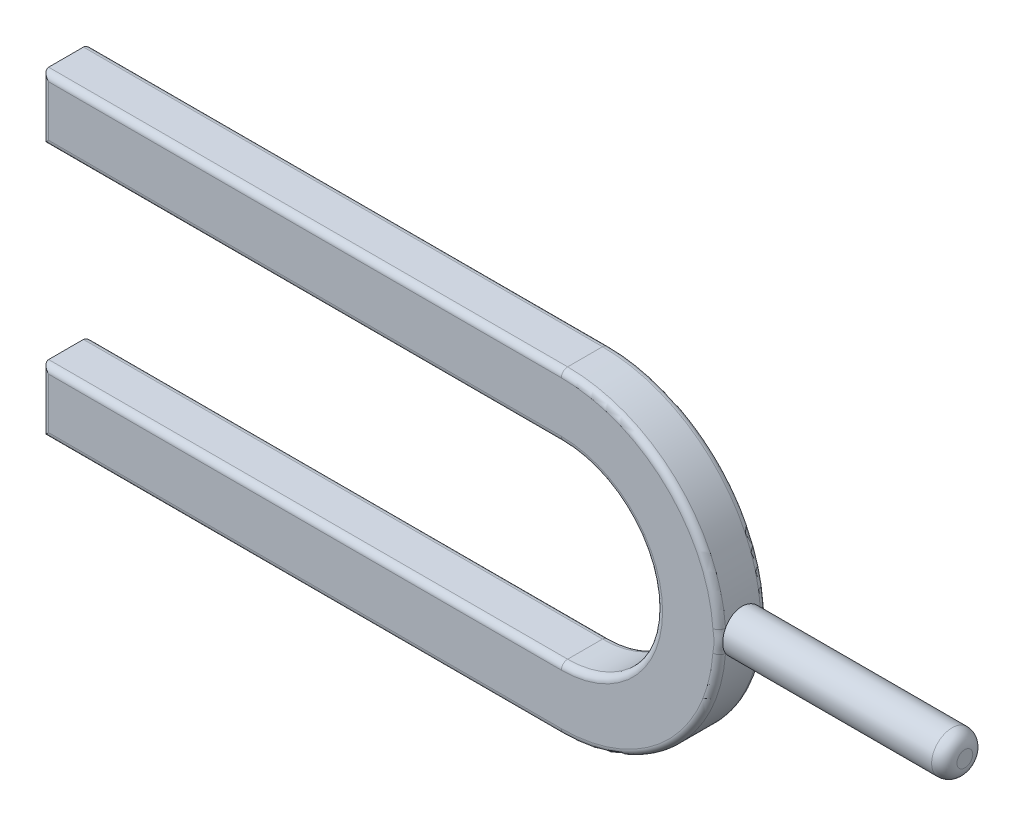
ISO-10303-21;
HEADER;
FILE_DESCRIPTION(('STEP AP214'),'2;1');
FILE_NAME('part.step','',(''),(''),'','','');
FILE_SCHEMA(('AUTOMOTIVE_DESIGN { 1 0 10303 214 1 1 1 1 }'));
ENDSEC;
DATA;
#1=APPLICATION_CONTEXT('core data for automotive mechanical design processes');
#2=APPLICATION_PROTOCOL_DEFINITION('international standard','automotive_design',2000,#1);
#3=PRODUCT_CONTEXT('',#1,'mechanical');
#4=PRODUCT('Part','Part','',(#3));
#5=PRODUCT_RELATED_PRODUCT_CATEGORY('part','',(#4));
#6=PRODUCT_DEFINITION_FORMATION('','',#4);
#7=PRODUCT_DEFINITION_CONTEXT('part definition',#1,'design');
#8=PRODUCT_DEFINITION('design','',#6,#7);
#9=PRODUCT_DEFINITION_SHAPE('','',#8);
#10=(LENGTH_UNIT() NAMED_UNIT(*) SI_UNIT(.MILLI.,.METRE.));
#11=(NAMED_UNIT(*) PLANE_ANGLE_UNIT() SI_UNIT($,.RADIAN.));
#12=(NAMED_UNIT(*) SI_UNIT($,.STERADIAN.) SOLID_ANGLE_UNIT());
#13=UNCERTAINTY_MEASURE_WITH_UNIT(LENGTH_MEASURE(1.E-05),#10,'distance_accuracy_value','');
#14=(GEOMETRIC_REPRESENTATION_CONTEXT(3) GLOBAL_UNCERTAINTY_ASSIGNED_CONTEXT((#13)) GLOBAL_UNIT_ASSIGNED_CONTEXT((#10,
#11,#12)) REPRESENTATION_CONTEXT('',''));
#15=CARTESIAN_POINT('',(0.,0.,0.));
#16=DIRECTION('',(0.,0.,1.));
#17=DIRECTION('',(1.,0.,0.));
#18=AXIS2_PLACEMENT_3D('',#15,#16,#17);
#19=CARTESIAN_POINT('',(0.,0.,3.75));
#20=DIRECTION('',(0.,0.,-1.));
#21=DIRECTION('',(-1.,0.,0.));
#22=AXIS2_PLACEMENT_3D('',#19,#20,#21);
#23=CYLINDRICAL_SURFACE('',#22,25.);
#24=DIRECTION('',(0.,0.,-1.));
#25=VECTOR('',#24,1.);
#26=CARTESIAN_POINT('',(0.,25.,3.75));
#27=LINE('',#26,#25);
#28=CARTESIAN_POINT('',(0.,25.,2.75));
#29=VERTEX_POINT('',#28);
#30=CARTESIAN_POINT('',(0.,25.,-2.75));
#31=VERTEX_POINT('',#30);
#32=EDGE_CURVE('E476',#29,#31,#27,.T.);
#33=ORIENTED_EDGE('',*,*,#32,.F.);
#34=CARTESIAN_POINT('',(0.,0.,2.75));
#35=DIRECTION('',(0.,0.,-1.));
#36=DIRECTION('',(-1.,0.,0.));
#37=AXIS2_PLACEMENT_3D('',#34,#35,#36);
#38=CIRCLE('',#37,25.);
#39=CARTESIAN_POINT('',(24.9399278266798,1.73205080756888,2.75));
#40=VERTEX_POINT('',#39);
#41=EDGE_CURVE('E463',#29,#40,#38,.T.);
#42=ORIENTED_EDGE('',*,*,#41,.T.);
#43=CARTESIAN_POINT('',(25.,0.,-3.25));
#44=CARTESIAN_POINT('',(24.9999973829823,0.181731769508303,-3.2499923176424));
#45=CARTESIAN_POINT('',(24.9979975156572,0.363575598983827,-3.23470562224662));
#46=CARTESIAN_POINT('',(24.990212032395,0.722198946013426,-3.17396769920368));
#47=CARTESIAN_POINT('',(24.9844225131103,0.898973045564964,-3.12848536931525));
#48=CARTESIAN_POINT('',(24.9697096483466,1.24221354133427,-3.00872246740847));
#49=CARTESIAN_POINT('',(24.9607884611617,1.40868694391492,-2.93446172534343));
#50=CARTESIAN_POINT('',(24.9408032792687,1.72677821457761,-2.75929434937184));
#51=CARTESIAN_POINT('',(24.9297396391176,1.87839853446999,-2.65839212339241));
#52=CARTESIAN_POINT('',(24.906630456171,2.16341005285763,-2.43216621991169));
#53=CARTESIAN_POINT('',(24.8945800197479,2.296700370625,-2.30671593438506));
#54=CARTESIAN_POINT('',(24.8708946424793,2.54039914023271,-2.0352269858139));
#55=CARTESIAN_POINT('',(24.8592597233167,2.6508063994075,-1.88918725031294));
#56=CARTESIAN_POINT('',(24.8376747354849,2.84598409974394,-1.58000496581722));
#57=CARTESIAN_POINT('',(24.827730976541,2.93065942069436,-1.41680189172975));
#58=CARTESIAN_POINT('',(24.8107192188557,3.07136209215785,-1.07834094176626));
#59=CARTESIAN_POINT('',(24.8036511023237,3.1273906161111,-0.903083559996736));
#60=CARTESIAN_POINT('',(24.7932379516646,3.20890136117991,-0.546538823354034));
#61=CARTESIAN_POINT('',(24.7898721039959,3.23455441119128,-0.365291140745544));
#62=CARTESIAN_POINT('',(24.7871810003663,3.25511472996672,-0.00103445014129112));
#63=CARTESIAN_POINT('',(24.7878555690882,3.25002333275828,0.181974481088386));
#64=CARTESIAN_POINT('',(24.7931500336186,3.20937939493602,0.543365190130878));
#65=CARTESIAN_POINT('',(24.7977455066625,3.17401541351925,0.721768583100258));
#66=CARTESIAN_POINT('',(24.8103258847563,3.07412453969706,1.07008719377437));
#67=CARTESIAN_POINT('',(24.818310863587,3.00959701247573,1.24000222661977));
#68=CARTESIAN_POINT('',(24.8367981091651,2.85300929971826,1.56710438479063));
#69=CARTESIAN_POINT('',(24.8473078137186,2.76086756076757,1.72425203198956));
#70=CARTESIAN_POINT('',(24.8696546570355,2.55172528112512,2.0209258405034));
#71=CARTESIAN_POINT('',(24.881491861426,2.43472351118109,2.16045112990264));
#72=CARTESIAN_POINT('',(24.9052683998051,2.17813926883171,2.41901377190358));
#73=CARTESIAN_POINT('',(24.917207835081,2.03839434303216,2.53788996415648));
#74=CARTESIAN_POINT('',(24.9397607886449,1.74084892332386,2.75052381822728));
#75=CARTESIAN_POINT('',(24.9503743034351,1.58304838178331,2.84428141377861));
#76=CARTESIAN_POINT('',(24.9690869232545,1.25374396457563,3.00401826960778));
#77=CARTESIAN_POINT('',(24.9771850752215,1.08223492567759,3.06998700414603));
#78=CARTESIAN_POINT('',(24.9899460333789,0.730445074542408,3.17214333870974));
#79=CARTESIAN_POINT('',(24.9946090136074,0.55016470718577,3.2083324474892));
#80=CARTESIAN_POINT('',(24.9999515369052,0.187342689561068,3.24969237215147));
#81=CARTESIAN_POINT('',(25.0006595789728,0.004826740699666,3.25508511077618));
#82=CARTESIAN_POINT('',(24.9980895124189,-0.358506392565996,3.23528550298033));
#83=CARTESIAN_POINT('',(24.9948114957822,-0.539323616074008,3.21009386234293));
#84=CARTESIAN_POINT('',(24.9846553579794,-0.89346850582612,3.13002499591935));
#85=CARTESIAN_POINT('',(24.9777901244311,-1.06682059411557,3.07525401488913));
#86=CARTESIAN_POINT('',(24.9612278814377,-1.40187959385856,2.93769196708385));
#87=CARTESIAN_POINT('',(24.9515307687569,-1.56358608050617,2.85489987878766));
#88=CARTESIAN_POINT('',(24.9303141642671,-1.87175191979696,2.66311188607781));
#89=CARTESIAN_POINT('',(24.9187848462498,-2.01812156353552,2.5539729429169));
#90=CARTESIAN_POINT('',(24.8952231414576,-2.29054507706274,2.31279105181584));
#91=CARTESIAN_POINT('',(24.8831907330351,-2.41659807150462,2.18074711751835));
#92=CARTESIAN_POINT('',(24.8598905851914,-2.64560124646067,1.89652394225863));
#93=CARTESIAN_POINT('',(24.8486280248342,-2.74840400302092,1.74422543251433));
#94=CARTESIAN_POINT('',(24.8282291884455,-2.92696888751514,1.42439296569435));
#95=CARTESIAN_POINT('',(24.8190928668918,-3.00273159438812,1.25685933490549));
#96=CARTESIAN_POINT('',(24.8040166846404,-3.12482895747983,0.91178124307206));
#97=CARTESIAN_POINT('',(24.7980679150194,-3.17124569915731,0.734266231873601));
#98=CARTESIAN_POINT('',(24.7900151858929,-3.23359734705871,0.373878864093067));
#99=CARTESIAN_POINT('',(24.787911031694,-3.24953379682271,0.191006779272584));
#100=CARTESIAN_POINT('',(24.7877917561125,-3.25044259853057,-0.173436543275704));
#101=CARTESIAN_POINT('',(24.7897460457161,-3.2356465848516,-0.355007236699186));
#102=CARTESIAN_POINT('',(24.7974575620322,-3.17600206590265,-0.713057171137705));
#103=CARTESIAN_POINT('',(24.8032147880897,-3.13115356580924,-0.889536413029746));
#104=CARTESIAN_POINT('',(24.8178737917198,-3.01275139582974,-1.23235704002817));
#105=CARTESIAN_POINT('',(24.8267742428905,-2.93920983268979,-1.39870266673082));
#106=CARTESIAN_POINT('',(24.8467189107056,-2.76553187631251,-1.71673021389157));
#107=CARTESIAN_POINT('',(24.8577631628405,-2.66539504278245,-1.86841189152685));
#108=CARTESIAN_POINT('',(24.8808506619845,-2.44051280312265,-2.15398873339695));
#109=CARTESIAN_POINT('',(24.8929005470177,-2.31559491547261,-2.28774754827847));
#110=CARTESIAN_POINT('',(24.9165835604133,-2.0450578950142,-2.53249176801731));
#111=CARTESIAN_POINT('',(24.9282165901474,-1.89943390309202,-2.64347181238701));
#112=CARTESIAN_POINT('',(24.9498083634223,-1.59092810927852,-2.83990066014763));
#113=CARTESIAN_POINT('',(24.9597600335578,-1.42797787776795,-2.92524272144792));
#114=CARTESIAN_POINT('',(24.9767967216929,-1.09001729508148,-3.06722758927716));
#115=CARTESIAN_POINT('',(24.9838848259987,-0.915020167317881,-3.12390131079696));
#116=CARTESIAN_POINT('',(24.9927037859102,-0.615949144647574,-3.1935053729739));
#117=CARTESIAN_POINT('',(24.9954264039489,-0.493754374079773,-3.21466005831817));
#118=CARTESIAN_POINT('',(24.9990753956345,-0.247723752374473,-3.24290993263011));
#119=CARTESIAN_POINT('',(25.0000017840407,-0.123887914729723,-3.25000523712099));
#120=CARTESIAN_POINT('',(25.,0.,-3.25));
#121=B_SPLINE_CURVE_WITH_KNOTS('',3,(#43,#44,#45,#46,#47,#48,#49,#50,#51,#52,#53,#54,#55,#56,
#57,#58,#59,#60,#61,#62,#63,#64,#65,#66,#67,#68,#69,#70,#71,#72,#73,#74,#75,#76,#77,#78,#79,#80,
#81,#82,#83,#84,#85,#86,#87,#88,#89,#90,#91,#92,#93,#94,#95,#96,#97,#98,#99,#100,#101,#102,#103,
#104,#105,#106,#107,#108,#109,#110,#111,#112,#113,#114,#115,#116,#117,#118,#119,#120),
.UNSPECIFIED.,.T.,.F.,(4,2,2,2,2,2,2,2,2,2,2,2,2,2,2,2,2,2,2,2,2,2,2,2,2,2,2,2,2,2,2,2,2,2,2,2,
2,2,4),(0.,0.544742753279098,1.09004747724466,1.63497712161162,2.17981666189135,
2.72754405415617,3.27529998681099,3.8250567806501,4.37479105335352,4.9214187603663,
5.46802274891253,6.01124666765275,6.55448241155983,7.09933858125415,7.6442216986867,
8.19318305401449,8.74214585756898,9.29131640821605,9.84045913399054,10.3856396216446,
10.9308075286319,11.4740301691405,12.0172726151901,12.5635334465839,13.1098178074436,
13.6594745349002,14.2091194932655,14.7572201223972,15.3052929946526,15.8492499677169,
16.393206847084,16.9369344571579,17.4806710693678,18.0283341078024,18.5761258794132,
19.1261677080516,19.6756151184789,20.0469734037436,20.4183286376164),.UNSPECIFIED.);
#122=CARTESIAN_POINT('',(24.9399278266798,1.73205080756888,-2.75));
#123=VERTEX_POINT('',#122);
#124=EDGE_CURVE('E483',#123,#40,#121,.T.);
#125=ORIENTED_EDGE('',*,*,#124,.F.);
#126=CARTESIAN_POINT('',(0.,0.,-2.75));
#127=DIRECTION('',(0.,0.,-1.));
#128=DIRECTION('',(-1.,0.,0.));
#129=AXIS2_PLACEMENT_3D('',#126,#127,#128);
#130=CIRCLE('',#129,25.);
#131=EDGE_CURVE('E468',#123,#31,#130,.F.);
#132=ORIENTED_EDGE('',*,*,#131,.T.);
#133=EDGE_LOOP('',(#33,#42,#125,#132));
#134=FACE_BOUND('',#133,.T.);
#135=ADVANCED_FACE('F40',(#134),#23,.T.);
#136=CARTESIAN_POINT('',(-82.,15.,3.75));
#137=DIRECTION('',(1.,0.,0.));
#138=DIRECTION('',(0.,0.,-1.));
#139=AXIS2_PLACEMENT_3D('',#136,#137,#138);
#140=PLANE('',#139);
#141=DIRECTION('',(0.,0.,-1.));
#142=VECTOR('',#141,1.);
#143=CARTESIAN_POINT('',(-82.,15.,3.75));
#144=LINE('',#143,#142);
#145=CARTESIAN_POINT('',(-82.,15.,2.75));
#146=VERTEX_POINT('',#145);
#147=CARTESIAN_POINT('',(-82.,15.,-2.75));
#148=VERTEX_POINT('',#147);
#149=EDGE_CURVE('E497',#146,#148,#144,.T.);
#150=ORIENTED_EDGE('',*,*,#149,.F.);
#151=DIRECTION('',(0.,-1.,0.));
#152=VECTOR('',#151,1.);
#153=CARTESIAN_POINT('',(-82.,15.,2.75));
#154=LINE('',#153,#152);
#155=CARTESIAN_POINT('',(-82.,25.,2.75));
#156=VERTEX_POINT('',#155);
#157=EDGE_CURVE('E438',#146,#156,#154,.F.);
#158=ORIENTED_EDGE('',*,*,#157,.T.);
#159=DIRECTION('',(0.,0.,-1.));
#160=VECTOR('',#159,1.);
#161=CARTESIAN_POINT('',(-82.,25.,3.75));
#162=LINE('',#161,#160);
#163=CARTESIAN_POINT('',(-82.,25.,-2.75));
#164=VERTEX_POINT('',#163);
#165=EDGE_CURVE('E475',#156,#164,#162,.T.);
#166=ORIENTED_EDGE('',*,*,#165,.T.);
#167=DIRECTION('',(0.,-1.,0.));
#168=VECTOR('',#167,1.);
#169=CARTESIAN_POINT('',(-82.,15.,-2.75));
#170=LINE('',#169,#168);
#171=EDGE_CURVE('E440',#164,#148,#170,.T.);
#172=ORIENTED_EDGE('',*,*,#171,.T.);
#173=EDGE_LOOP('',(#150,#158,#166,#172));
#174=FACE_BOUND('',#173,.T.);
#175=ADVANCED_FACE('F480',(#174),#140,.F.);
#176=CARTESIAN_POINT('',(-82.,15.,3.75));
#177=DIRECTION('',(0.,1.,0.));
#178=DIRECTION('',(-1.,0.,0.));
#179=AXIS2_PLACEMENT_3D('',#176,#177,#178);
#180=PLANE('',#179);
#181=DIRECTION('',(0.,0.,-1.));
#182=VECTOR('',#181,1.);
#183=CARTESIAN_POINT('',(0.,15.,3.75));
#184=LINE('',#183,#182);
#185=CARTESIAN_POINT('',(0.,15.,2.75));
#186=VERTEX_POINT('',#185);
#187=CARTESIAN_POINT('',(0.,15.,-2.75));
#188=VERTEX_POINT('',#187);
#189=EDGE_CURVE('E495',#186,#188,#184,.T.);
#190=ORIENTED_EDGE('',*,*,#189,.F.);
#191=DIRECTION('',(1.,0.,0.));
#192=VECTOR('',#191,1.);
#193=CARTESIAN_POINT('',(-82.,15.,2.75));
#194=LINE('',#193,#192);
#195=EDGE_CURVE('E442',#186,#146,#194,.F.);
#196=ORIENTED_EDGE('',*,*,#195,.T.);
#197=ORIENTED_EDGE('',*,*,#149,.T.);
#198=DIRECTION('',(1.,0.,0.));
#199=VECTOR('',#198,1.);
#200=CARTESIAN_POINT('',(0.,15.,-2.75));
#201=LINE('',#200,#199);
#202=EDGE_CURVE('E444',#148,#188,#201,.T.);
#203=ORIENTED_EDGE('',*,*,#202,.T.);
#204=EDGE_LOOP('',(#190,#196,#197,#203));
#205=FACE_BOUND('',#204,.T.);
#206=ADVANCED_FACE('F494',(#205),#180,.F.);
#207=CARTESIAN_POINT('',(0.,0.,3.75));
#208=DIRECTION('',(0.,0.,-1.));
#209=DIRECTION('',(-1.,0.,0.));
#210=AXIS2_PLACEMENT_3D('',#207,#208,#209);
#211=CYLINDRICAL_SURFACE('',#210,15.);
#212=DIRECTION('',(0.,0.,-1.));
#213=VECTOR('',#212,1.);
#214=CARTESIAN_POINT('',(0.,-15.,3.75));
#215=LINE('',#214,#213);
#216=CARTESIAN_POINT('',(0.,-15.,2.75));
#217=VERTEX_POINT('',#216);
#218=CARTESIAN_POINT('',(0.,-15.,-2.75));
#219=VERTEX_POINT('',#218);
#220=EDGE_CURVE('E502',#217,#219,#215,.T.);
#221=ORIENTED_EDGE('',*,*,#220,.F.);
#222=CARTESIAN_POINT('',(0.,0.,2.75));
#223=DIRECTION('',(0.,0.,-1.));
#224=DIRECTION('',(-1.,0.,0.));
#225=AXIS2_PLACEMENT_3D('',#222,#223,#224);
#226=CIRCLE('',#225,15.);
#227=EDGE_CURVE('E447',#217,#186,#226,.F.);
#228=ORIENTED_EDGE('',*,*,#227,.T.);
#229=ORIENTED_EDGE('',*,*,#189,.T.);
#230=CARTESIAN_POINT('',(0.,0.,-2.75));
#231=DIRECTION('',(0.,0.,-1.));
#232=DIRECTION('',(-1.,0.,0.));
#233=AXIS2_PLACEMENT_3D('',#230,#231,#232);
#234=CIRCLE('',#233,15.);
#235=EDGE_CURVE('E449',#188,#219,#234,.T.);
#236=ORIENTED_EDGE('',*,*,#235,.T.);
#237=EDGE_LOOP('',(#221,#228,#229,#236));
#238=FACE_BOUND('',#237,.T.);
#239=ADVANCED_FACE('F500',(#238),#211,.F.);
#240=CARTESIAN_POINT('',(0.,-15.,3.75));
#241=DIRECTION('',(0.,-1.,0.));
#242=DIRECTION('',(1.,0.,0.));
#243=AXIS2_PLACEMENT_3D('',#240,#241,#242);
#244=PLANE('',#243);
#245=DIRECTION('',(0.,0.,-1.));
#246=VECTOR('',#245,1.);
#247=CARTESIAN_POINT('',(-82.,-15.,3.75));
#248=LINE('',#247,#246);
#249=CARTESIAN_POINT('',(-82.,-15.,2.75));
#250=VERTEX_POINT('',#249);
#251=CARTESIAN_POINT('',(-82.,-15.,-2.75));
#252=VERTEX_POINT('',#251);
#253=EDGE_CURVE('E506',#250,#252,#248,.T.);
#254=ORIENTED_EDGE('',*,*,#253,.F.);
#255=DIRECTION('',(-1.,0.,0.));
#256=VECTOR('',#255,1.);
#257=CARTESIAN_POINT('',(0.,-15.,2.75));
#258=LINE('',#257,#256);
#259=EDGE_CURVE('E451',#250,#217,#258,.F.);
#260=ORIENTED_EDGE('',*,*,#259,.T.);
#261=ORIENTED_EDGE('',*,*,#220,.T.);
#262=DIRECTION('',(-1.,0.,0.));
#263=VECTOR('',#262,1.);
#264=CARTESIAN_POINT('',(-82.,-15.,-2.75));
#265=LINE('',#264,#263);
#266=EDGE_CURVE('E453',#219,#252,#265,.T.);
#267=ORIENTED_EDGE('',*,*,#266,.T.);
#268=EDGE_LOOP('',(#254,#260,#261,#267));
#269=FACE_BOUND('',#268,.T.);
#270=ADVANCED_FACE('F565',(#269),#244,.F.);
#271=CARTESIAN_POINT('',(-82.,-15.,3.75));
#272=DIRECTION('',(1.,0.,0.));
#273=DIRECTION('',(0.,0.,-1.));
#274=AXIS2_PLACEMENT_3D('',#271,#272,#273);
#275=PLANE('',#274);
#276=DIRECTION('',(0.,0.,-1.));
#277=VECTOR('',#276,1.);
#278=CARTESIAN_POINT('',(-82.,-25.,3.75));
#279=LINE('',#278,#277);
#280=CARTESIAN_POINT('',(-82.,-25.,2.75));
#281=VERTEX_POINT('',#280);
#282=CARTESIAN_POINT('',(-82.,-25.,-2.75));
#283=VERTEX_POINT('',#282);
#284=EDGE_CURVE('E547',#281,#283,#279,.T.);
#285=ORIENTED_EDGE('',*,*,#284,.F.);
#286=DIRECTION('',(0.,-1.,0.));
#287=VECTOR('',#286,1.);
#288=CARTESIAN_POINT('',(-82.,-15.,2.75));
#289=LINE('',#288,#287);
#290=EDGE_CURVE('E455',#281,#250,#289,.F.);
#291=ORIENTED_EDGE('',*,*,#290,.T.);
#292=ORIENTED_EDGE('',*,*,#253,.T.);
#293=DIRECTION('',(0.,-1.,0.));
#294=VECTOR('',#293,1.);
#295=CARTESIAN_POINT('',(-82.,-25.,-2.75));
#296=LINE('',#295,#294);
#297=EDGE_CURVE('E457',#252,#283,#296,.T.);
#298=ORIENTED_EDGE('',*,*,#297,.T.);
#299=EDGE_LOOP('',(#285,#291,#292,#298));
#300=FACE_BOUND('',#299,.T.);
#301=ADVANCED_FACE('F557',(#300),#275,.F.);
#302=CARTESIAN_POINT('',(-82.,-25.,3.75));
#303=DIRECTION('',(0.,1.,0.));
#304=DIRECTION('',(0.,0.,1.));
#305=AXIS2_PLACEMENT_3D('',#302,#303,#304);
#306=PLANE('',#305);
#307=DIRECTION('',(0.,0.,-1.));
#308=VECTOR('',#307,1.);
#309=CARTESIAN_POINT('',(0.,-25.,3.75));
#310=LINE('',#309,#308);
#311=CARTESIAN_POINT('',(0.,-25.,2.75));
#312=VERTEX_POINT('',#311);
#313=CARTESIAN_POINT('',(0.,-25.,-2.75));
#314=VERTEX_POINT('',#313);
#315=EDGE_CURVE('E545',#312,#314,#310,.T.);
#316=ORIENTED_EDGE('',*,*,#315,.F.);
#317=DIRECTION('',(1.,0.,0.));
#318=VECTOR('',#317,1.);
#319=CARTESIAN_POINT('',(-82.,-25.,2.75));
#320=LINE('',#319,#318);
#321=EDGE_CURVE('E459',#312,#281,#320,.F.);
#322=ORIENTED_EDGE('',*,*,#321,.T.);
#323=ORIENTED_EDGE('',*,*,#284,.T.);
#324=DIRECTION('',(1.,0.,0.));
#325=VECTOR('',#324,1.);
#326=CARTESIAN_POINT('',(0.,-25.,-2.75));
#327=LINE('',#326,#325);
#328=EDGE_CURVE('E461',#283,#314,#327,.T.);
#329=ORIENTED_EDGE('',*,*,#328,.T.);
#330=EDGE_LOOP('',(#316,#322,#323,#329));
#331=FACE_BOUND('',#330,.T.);
#332=ADVANCED_FACE('F581',(#331),#306,.F.);
#333=CARTESIAN_POINT('',(24.9399278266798,-1.73205080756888,2.75));
#334=VERTEX_POINT('',#333);
#335=CARTESIAN_POINT('',(24.9399278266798,-1.73205080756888,-2.75));
#336=VERTEX_POINT('',#335);
#337=EDGE_CURVE('E537',#334,#336,#121,.T.);
#338=ORIENTED_EDGE('',*,*,#337,.F.);
#339=CARTESIAN_POINT('',(0.,0.,2.75));
#340=DIRECTION('',(0.,0.,-1.));
#341=DIRECTION('',(-1.,0.,0.));
#342=AXIS2_PLACEMENT_3D('',#339,#340,#341);
#343=CIRCLE('',#342,25.);
#344=EDGE_CURVE('E465',#334,#312,#343,.T.);
#345=ORIENTED_EDGE('',*,*,#344,.T.);
#346=ORIENTED_EDGE('',*,*,#315,.T.);
#347=CARTESIAN_POINT('',(0.,0.,-2.75));
#348=DIRECTION('',(0.,0.,-1.));
#349=DIRECTION('',(-1.,0.,0.));
#350=AXIS2_PLACEMENT_3D('',#347,#348,#349);
#351=CIRCLE('',#350,25.);
#352=EDGE_CURVE('E427',#314,#336,#351,.F.);
#353=ORIENTED_EDGE('',*,*,#352,.T.);
#354=EDGE_LOOP('',(#338,#345,#346,#353));
#355=FACE_BOUND('',#354,.T.);
#356=ADVANCED_FACE('F542',(#355),#23,.T.);
#357=CARTESIAN_POINT('',(-82.,25.,3.75));
#358=DIRECTION('',(0.,-1.,0.));
#359=DIRECTION('',(0.,0.,-1.));
#360=AXIS2_PLACEMENT_3D('',#357,#358,#359);
#361=PLANE('',#360);
#362=ORIENTED_EDGE('',*,*,#165,.F.);
#363=DIRECTION('',(-1.,0.,0.));
#364=VECTOR('',#363,1.);
#365=CARTESIAN_POINT('',(-82.,25.,2.75));
#366=LINE('',#365,#364);
#367=EDGE_CURVE('E187',#156,#29,#366,.F.);
#368=ORIENTED_EDGE('',*,*,#367,.T.);
#369=ORIENTED_EDGE('',*,*,#32,.T.);
#370=DIRECTION('',(-1.,0.,0.));
#371=VECTOR('',#370,1.);
#372=CARTESIAN_POINT('',(-82.,25.,-2.75));
#373=LINE('',#372,#371);
#374=EDGE_CURVE('E221',#31,#164,#373,.T.);
#375=ORIENTED_EDGE('',*,*,#374,.T.);
#376=EDGE_LOOP('',(#362,#368,#369,#375));
#377=FACE_BOUND('',#376,.T.);
#378=ADVANCED_FACE('F333',(#377),#361,.F.);
#379=CARTESIAN_POINT('',(0.,0.,3.75));
#380=DIRECTION('',(0.,0.,-1.));
#381=DIRECTION('',(-1.,0.,0.));
#382=AXIS2_PLACEMENT_3D('',#379,#380,#381);
#383=PLANE('',#382);
#384=CARTESIAN_POINT('',(0.,0.,3.75));
#385=DIRECTION('',(0.,0.,-1.));
#386=DIRECTION('',(-1.,0.,0.));
#387=AXIS2_PLACEMENT_3D('',#384,#385,#386);
#388=CIRCLE('',#387,24.);
#389=CARTESIAN_POINT('',(0.,-24.,3.75));
#390=VERTEX_POINT('',#389);
#391=CARTESIAN_POINT('',(23.9423307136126,-1.66276877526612,3.75));
#392=VERTEX_POINT('',#391);
#393=EDGE_CURVE('E207',#390,#392,#388,.F.);
#394=ORIENTED_EDGE('',*,*,#393,.T.);
#395=CARTESIAN_POINT('',(24.9117250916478,-2.09903630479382,2.48123891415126));
#396=CARTESIAN_POINT('',(25.2615881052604,-2.04494964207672,3.75));
#397=CARTESIAN_POINT('',(23.9598258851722,-2.2461940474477,3.75));
#398=CARTESIAN_POINT('',(24.9148512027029,-2.06190381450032,2.51264648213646));
#399=CARTESIAN_POINT('',(25.2146922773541,-2.02907728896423,3.75));
#400=CARTESIAN_POINT('',(23.9489640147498,-2.17577398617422,3.75));
#401=CARTESIAN_POINT('',(24.9181232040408,-2.02210614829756,2.54488741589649));
#402=CARTESIAN_POINT('',(25.1692421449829,-2.00295741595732,3.75));
#403=CARTESIAN_POINT('',(23.9419080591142,-2.10490734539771,3.75));
#404=CARTESIAN_POINT('',(24.9248674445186,-1.93721607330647,2.61008449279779));
#405=CARTESIAN_POINT('',(25.0854794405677,-1.93503043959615,3.75));
#406=CARTESIAN_POINT('',(23.9340724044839,-1.96316456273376,3.75));
#407=CARTESIAN_POINT('',(24.9283385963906,-1.89215123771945,2.64303623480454));
#408=CARTESIAN_POINT('',(25.0468297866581,-1.89386341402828,3.75));
#409=CARTESIAN_POINT('',(23.9332613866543,-1.89229025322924,3.75));
#410=CARTESIAN_POINT('',(24.9354253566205,-1.7963541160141,2.70906131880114));
#411=CARTESIAN_POINT('',(24.9774062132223,-1.7999553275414,3.75));
#412=CARTESIAN_POINT('',(23.9364995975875,-1.75064071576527,3.75));
#413=CARTESIAN_POINT('',(24.9390410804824,-1.7456172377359,2.74213473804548));
#414=CARTESIAN_POINT('',(24.9463040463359,-1.74751884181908,3.75));
#415=CARTESIAN_POINT('',(23.9405527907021,-1.67986561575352,3.75));
#416=CARTESIAN_POINT('',(24.946327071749,-1.63818733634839,2.80763307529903));
#417=CARTESIAN_POINT('',(24.8915609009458,-1.63408014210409,3.75));
#418=CARTESIAN_POINT('',(23.9522952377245,-1.53844961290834,3.75));
#419=CARTESIAN_POINT('',(24.9499974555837,-1.58147931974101,2.84005610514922));
#420=CARTESIAN_POINT('',(24.8676426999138,-1.57318973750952,3.75));
#421=CARTESIAN_POINT('',(23.9599938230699,-1.46780952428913,3.75));
#422=CARTESIAN_POINT('',(24.9592158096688,-1.43032153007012,2.92015796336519));
#423=CARTESIAN_POINT('',(24.8160073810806,-1.41229579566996,3.75));
#424=CARTESIAN_POINT('',(23.9825813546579,-1.28920476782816,3.75));
#425=CARTESIAN_POINT('',(24.9647193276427,-1.33189333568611,2.96673348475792));
#426=CARTESIAN_POINT('',(24.7917951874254,-1.3069230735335,3.75));
#427=CARTESIAN_POINT('',(23.9991144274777,-1.18146064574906,3.75));
#428=CARTESIAN_POINT('',(24.9750704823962,-1.1211060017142,3.05262314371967));
#429=CARTESIAN_POINT('',(24.7554736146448,-1.08686893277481,3.75));
#430=CARTESIAN_POINT('',(24.033584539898,-0.966132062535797,3.75));
#431=CARTESIAN_POINT('',(24.979917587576,-1.00873571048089,3.09193140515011));
#432=CARTESIAN_POINT('',(24.7428397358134,-0.971676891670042,3.75));
#433=CARTESIAN_POINT('',(24.0515226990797,-0.858547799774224,3.75));
#434=CARTESIAN_POINT('',(24.9862330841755,-0.83157320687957,3.14240790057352));
#435=CARTESIAN_POINT('',(24.7296194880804,-0.79398323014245,3.75));
#436=CARTESIAN_POINT('',(24.0761263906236,-0.69714794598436,3.75));
#437=CARTESIAN_POINT('',(24.9881743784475,-0.771289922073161,3.15778348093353));
#438=CARTESIAN_POINT('',(24.726159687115,-0.734508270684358,3.75));
#439=CARTESIAN_POINT('',(24.0839225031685,-0.643514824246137,3.75));
#440=CARTESIAN_POINT('',(24.9916744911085,-0.648065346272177,3.18535614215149));
#441=CARTESIAN_POINT('',(24.7206116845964,-0.61432917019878,3.75));
#442=CARTESIAN_POINT('',(24.0982522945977,-0.536083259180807,3.75));
#443=CARTESIAN_POINT('',(24.9932333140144,-0.585124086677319,3.19755326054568));
#444=CARTESIAN_POINT('',(24.7185037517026,-0.553495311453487,3.75));
#445=CARTESIAN_POINT('',(24.1047859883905,-0.482284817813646,3.75));
#446=CARTESIAN_POINT('',(24.9972260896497,-0.393448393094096,3.22867248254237));
#447=CARTESIAN_POINT('',(24.7136165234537,-0.370562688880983,3.75));
#448=CARTESIAN_POINT('',(24.1217213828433,-0.320722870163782,3.75));
#449=CARTESIAN_POINT('',(24.9989826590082,-0.261693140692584,3.24217216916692));
#450=CARTESIAN_POINT('',(24.7121683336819,-0.245673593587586,3.75));
#451=CARTESIAN_POINT('',(24.1294832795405,-0.212641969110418,3.75));
#452=CARTESIAN_POINT('',(25.0000117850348,-0.0620787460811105,3.25009337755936));
#453=CARTESIAN_POINT('',(24.7113178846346,-0.0581982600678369,3.75));
#454=CARTESIAN_POINT('',(24.1340311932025,-0.0503146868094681,3.75));
#455=CARTESIAN_POINT('',(25.0000870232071,0.00480664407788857,3.25067766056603));
#456=CARTESIAN_POINT('',(24.7112524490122,0.00450713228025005,3.75));
#457=CARTESIAN_POINT('',(24.1343638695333,0.00384232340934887,3.75));
#458=CARTESIAN_POINT('',(24.9997040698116,0.13814621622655,3.2477413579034));
#459=CARTESIAN_POINT('',(24.711563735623,0.129519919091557,3.75));
#460=CARTESIAN_POINT('',(24.1326747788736,0.112121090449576,3.75));
#461=CARTESIAN_POINT('',(24.9992458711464,0.204600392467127,3.24422071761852));
#462=CARTESIAN_POINT('',(24.7119413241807,0.191998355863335,3.75));
#463=CARTESIAN_POINT('',(24.1306529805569,0.166242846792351,3.75));
#464=CARTESIAN_POINT('',(24.9978198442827,0.33650318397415,3.23320490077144));
#465=CARTESIAN_POINT('',(24.7132667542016,0.316357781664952,3.75));
#466=CARTESIAN_POINT('',(24.1244173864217,0.274404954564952,3.75));
#467=CARTESIAN_POINT('',(24.9968515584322,0.401950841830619,3.22570615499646));
#468=CARTESIAN_POINT('',(24.7142190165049,0.37840346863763,3.75));
#469=CARTESIAN_POINT('',(24.1202016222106,0.328445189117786,3.75));
#470=CARTESIAN_POINT('',(24.9944442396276,0.530971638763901,3.20699589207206));
#471=CARTESIAN_POINT('',(24.7169645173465,0.501440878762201,3.75));
#472=CARTESIAN_POINT('',(24.1099014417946,0.436349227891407,3.75));
#473=CARTESIAN_POINT('',(24.9930051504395,0.594544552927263,3.19578393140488));
#474=CARTESIAN_POINT('',(24.7187668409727,0.562586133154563,3.75));
#475=CARTESIAN_POINT('',(24.103816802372,0.490213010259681,3.75));
#476=CARTESIAN_POINT('',(24.9897184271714,0.719543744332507,3.16998685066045));
#477=CARTESIAN_POINT('',(24.7235979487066,0.683833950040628,3.75));
#478=CARTESIAN_POINT('',(24.0902038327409,0.598081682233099,3.75));
#479=CARTESIAN_POINT('',(24.9878683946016,0.780954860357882,3.15538190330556));
#480=CARTESIAN_POINT('',(24.7266510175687,0.744061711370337,3.75));
#481=CARTESIAN_POINT('',(24.082667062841,0.652085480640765,3.75));
#482=CARTESIAN_POINT('',(24.983831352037,0.90094012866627,3.12324237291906));
#483=CARTESIAN_POINT('',(24.7344388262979,0.862902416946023,3.75));
#484=CARTESIAN_POINT('',(24.0666926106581,0.759956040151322,3.75));
#485=CARTESIAN_POINT('',(24.9816443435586,0.959514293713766,3.10570780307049));
#486=CARTESIAN_POINT('',(24.7392023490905,0.92163532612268,3.75));
#487=CARTESIAN_POINT('',(24.0582549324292,0.813822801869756,3.75));
#488=CARTESIAN_POINT('',(24.9746959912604,1.13030584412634,3.04947203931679));
#489=CARTESIAN_POINT('',(24.7568850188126,1.09600397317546,3.75));
#490=CARTESIAN_POINT('',(24.0324161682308,0.975305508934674,3.75));
#491=CARTESIAN_POINT('',(24.9695462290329,1.23763080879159,3.00713035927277));
#492=CARTESIAN_POINT('',(24.7732222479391,1.207978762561,3.75));
#493=CARTESIAN_POINT('',(24.0144845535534,1.08283662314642,3.75));
#494=CARTESIAN_POINT('',(24.961561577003,1.38661871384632,2.93982880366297));
#495=CARTESIAN_POINT('',(24.8063165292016,1.36414710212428,3.75));
#496=CARTESIAN_POINT('',(23.9900766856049,1.24274373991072,3.75));
#497=CARTESIAN_POINT('',(24.9589038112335,1.43358068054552,2.91717753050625));
#498=CARTESIAN_POINT('',(24.8187671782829,1.41428341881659,3.75));
#499=CARTESIAN_POINT('',(23.9824649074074,1.29494073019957,3.75));
#500=CARTESIAN_POINT('',(24.9535350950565,1.52419128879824,2.87087647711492));
#501=CARTESIAN_POINT('',(24.8470097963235,1.51130878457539,3.75));
#502=CARTESIAN_POINT('',(23.9684332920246,1.3994248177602,3.75));
#503=CARTESIAN_POINT('',(24.9508242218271,1.56784434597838,2.84722809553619));
#504=CARTESIAN_POINT('',(24.8628886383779,1.55821283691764,3.75));
#505=CARTESIAN_POINT('',(23.9620118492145,1.45171169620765,3.75));
#506=CARTESIAN_POINT('',(24.945407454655,1.65177529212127,2.79936866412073));
#507=CARTESIAN_POINT('',(24.8982883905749,1.64795729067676,3.75));
#508=CARTESIAN_POINT('',(23.9508541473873,1.55631877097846,3.75));
#509=CARTESIAN_POINT('',(24.9427015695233,1.69206273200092,2.77515947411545));
#510=CARTESIAN_POINT('',(24.9179075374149,1.69078426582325,3.75));
#511=CARTESIAN_POINT('',(23.9461129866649,1.60863841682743,3.75));
#512=CARTESIAN_POINT('',(24.9373278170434,1.76949400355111,2.72644169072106));
#513=CARTESIAN_POINT('',(24.9610508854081,1.77164492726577,3.75));
#514=CARTESIAN_POINT('',(23.9387858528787,1.71344955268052,3.75));
#515=CARTESIAN_POINT('',(24.9346599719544,1.8066360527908,2.70193293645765));
#516=CARTESIAN_POINT('',(24.9847002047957,1.80960370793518,3.75));
#517=CARTESIAN_POINT('',(23.9362010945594,1.76594112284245,3.75));
#518=CARTESIAN_POINT('',(24.9267636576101,1.91352021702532,2.62839052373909));
#519=CARTESIAN_POINT('',(25.0628517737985,1.91596727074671,3.75));
#520=CARTESIAN_POINT('',(23.932443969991,1.92373109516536,3.75));
#521=CARTESIAN_POINT('',(24.9216488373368,1.97862380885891,2.57939745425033));
#522=CARTESIAN_POINT('',(25.123308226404,1.97314664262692,3.75));
#523=CARTESIAN_POINT('',(23.9352839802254,2.02922388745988,3.75));
#524=CARTESIAN_POINT('',(24.9143482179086,2.06788216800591,2.50754743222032));
#525=CARTESIAN_POINT('',(25.2222860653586,2.0310318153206,3.75));
#526=CARTESIAN_POINT('',(23.9509523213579,2.18734875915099,3.75));
#527=CARTESIAN_POINT('',(24.9119561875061,2.09646038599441,2.48365668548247));
#528=CARTESIAN_POINT('',(25.2579532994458,2.04568958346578,3.75));
#529=CARTESIAN_POINT('',(23.9581988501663,2.24053144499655,3.75));
#530=CARTESIAN_POINT('',(24.9073344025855,2.15066810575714,2.43686300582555));
#531=CARTESIAN_POINT('',(25.3310277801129,2.06319064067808,3.75));
#532=CARTESIAN_POINT('',(23.9772468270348,2.34620110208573,3.75));
#533=CARTESIAN_POINT('',(24.9051050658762,2.17629010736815,2.41396267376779));
#534=CARTESIAN_POINT('',(25.3684979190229,2.06559988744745,3.75));
#535=CARTESIAN_POINT('',(23.9890595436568,2.3986860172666,3.75));
#536=CARTESIAN_POINT('',(24.902971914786,2.2004403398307,2.39174942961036));
#537=CARTESIAN_POINT('',(25.4051024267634,2.06083199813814,3.75));
#538=CARTESIAN_POINT('',(24.0034595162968,2.45053355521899,3.75));
#539=(BOUNDED_SURFACE() B_SPLINE_SURFACE(3,2,((#395,#396,#397),(#398,#399,#400),(#401,#402,
#403),(#404,#405,#406),(#407,#408,#409),(#410,#411,#412),(#413,#414,#415),(#416,#417,#418),
(#419,#420,#421),(#422,#423,#424),(#425,#426,#427),(#428,#429,#430),(#431,#432,#433),(#434,#435,
#436),(#437,#438,#439),(#440,#441,#442),(#443,#444,#445),(#446,#447,#448),(#449,#450,#451),
(#452,#453,#454),(#455,#456,#457),(#458,#459,#460),(#461,#462,#463),(#464,#465,#466),(#467,#468,
#469),(#470,#471,#472),(#473,#474,#475),(#476,#477,#478),(#479,#480,#481),(#482,#483,#484),
(#485,#486,#487),(#488,#489,#490),(#491,#492,#493),(#494,#495,#496),(#497,#498,#499),(#500,#501,
#502),(#503,#504,#505),(#506,#507,#508),(#509,#510,#511),(#512,#513,#514),(#515,#516,#517),
(#518,#519,#520),(#521,#522,#523),(#524,#525,#526),(#527,#528,#529),(#530,#531,#532),(#533,#534,
#535),(#536,#537,#538)),.UNSPECIFIED.,.F.,.F.,.F.) B_SPLINE_SURFACE_WITH_KNOTS((4,2,2,2,2,2,2,2,
2,2,2,2,2,2,2,2,2,2,2,2,2,2,2,4),(3,3),(0.,0.213457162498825,0.425843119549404,
0.638402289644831,0.851508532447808,1.17846059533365,1.5056758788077,1.66825187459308,
1.83082595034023,2.15551577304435,2.3179420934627,2.48037057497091,2.64294503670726,
2.80553892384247,2.96910797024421,3.13267628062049,3.45971362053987,3.61795139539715,
3.77597414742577,3.93353204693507,4.09117864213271,4.40683618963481,4.56768219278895,
4.72892769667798),(0.,1.),
.UNSPECIFIED.) GEOMETRIC_REPRESENTATION_ITEM() RATIONAL_B_SPLINE_SURFACE(((1.,0.604664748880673,
1.),(1.,0.617659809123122,1.),(1.,0.630561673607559,1.),(1.,0.655895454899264,1.),(1.,
0.66832940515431,1.),(1.,0.692588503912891,1.),(1.,0.704413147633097,1.),(1.,0.727287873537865,
1.),(1.,0.738335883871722,1.),(1.,0.765075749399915,1.),(1.,0.780095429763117,1.),(1.,
0.807152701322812,1.),(1.,0.819187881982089,1.),(1.,0.83440372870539,1.),(1.,0.838992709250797,
1.),(1.,0.847168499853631,1.),(1.,0.850755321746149,1.),(1.,0.859869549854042,1.),(1.,
0.863765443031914,1.),(1.,0.866052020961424,1.),(1.,0.866220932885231,1.),(1.,0.865373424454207,
1.),(1.,0.864356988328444,1.),(1.,0.861164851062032,1.),(1.,0.858988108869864,1.),(1.,
0.853525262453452,1.),(1.,0.85023902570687,1.),(1.,0.842619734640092,1.),(1.,0.838280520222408,
1.),(1.,0.828640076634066,1.),(1.,0.823338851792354,1.),(1.,0.806143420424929,1.),(1.,
0.792955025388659,1.),(1.,0.771339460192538,1.),(1.,0.763968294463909,1.),(1.,0.748663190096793,
1.),(1.,0.740730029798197,1.),(1.,0.724396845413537,1.),(1.,0.715998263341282,1.),(1.,
0.698781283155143,1.),(1.,0.689962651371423,1.),(1.,0.6629609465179,1.),(1.,0.644251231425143,
1.),(1.,0.615522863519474,1.),(1.,0.605742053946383,1.),(1.,0.586113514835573,1.),(1.,
0.576265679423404,1.),(1.,0.566459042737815,1.))) REPRESENTATION_ITEM('') SURFACE());
#540=CARTESIAN_POINT('',(23.9598258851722,-2.2461940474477,3.75));
#541=CARTESIAN_POINT('',(23.9489640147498,-2.17577398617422,3.75));
#542=CARTESIAN_POINT('',(23.9419080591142,-2.10490734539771,3.75));
#543=CARTESIAN_POINT('',(23.9340724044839,-1.96316456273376,3.75));
#544=CARTESIAN_POINT('',(23.9332613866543,-1.89229025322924,3.75));
#545=CARTESIAN_POINT('',(23.9364995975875,-1.75064071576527,3.75));
#546=CARTESIAN_POINT('',(23.9405527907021,-1.67986561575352,3.75));
#547=CARTESIAN_POINT('',(23.9522952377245,-1.53844961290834,3.75));
#548=CARTESIAN_POINT('',(23.9599938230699,-1.46780952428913,3.75));
#549=CARTESIAN_POINT('',(23.9825813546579,-1.28920476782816,3.75));
#550=CARTESIAN_POINT('',(23.9991144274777,-1.18146064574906,3.75));
#551=CARTESIAN_POINT('',(24.033584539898,-0.966132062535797,3.75));
#552=CARTESIAN_POINT('',(24.0515226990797,-0.858547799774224,3.75));
#553=CARTESIAN_POINT('',(24.0761263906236,-0.69714794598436,3.75));
#554=CARTESIAN_POINT('',(24.0839225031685,-0.643514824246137,3.75));
#555=CARTESIAN_POINT('',(24.0982522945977,-0.536083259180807,3.75));
#556=CARTESIAN_POINT('',(24.1047859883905,-0.482284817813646,3.75));
#557=CARTESIAN_POINT('',(24.1217213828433,-0.320722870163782,3.75));
#558=CARTESIAN_POINT('',(24.1294832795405,-0.212641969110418,3.75));
#559=CARTESIAN_POINT('',(24.1340311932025,-0.0503146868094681,3.75));
#560=CARTESIAN_POINT('',(24.1343638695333,0.00384232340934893,3.75));
#561=CARTESIAN_POINT('',(24.1326747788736,0.112121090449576,3.75));
#562=CARTESIAN_POINT('',(24.1306529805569,0.166242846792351,3.75));
#563=CARTESIAN_POINT('',(24.1244173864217,0.274404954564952,3.75));
#564=CARTESIAN_POINT('',(24.1202016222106,0.328445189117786,3.75));
#565=CARTESIAN_POINT('',(24.1099014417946,0.436349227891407,3.75));
#566=CARTESIAN_POINT('',(24.103816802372,0.490213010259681,3.75));
#567=CARTESIAN_POINT('',(24.0902038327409,0.598081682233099,3.75));
#568=CARTESIAN_POINT('',(24.082667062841,0.652085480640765,3.75));
#569=CARTESIAN_POINT('',(24.0666926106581,0.759956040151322,3.75));
#570=CARTESIAN_POINT('',(24.0582549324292,0.813822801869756,3.75));
#571=CARTESIAN_POINT('',(24.0324161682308,0.975305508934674,3.75));
#572=CARTESIAN_POINT('',(24.0144845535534,1.08283662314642,3.75));
#573=CARTESIAN_POINT('',(23.9900766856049,1.24274373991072,3.75));
#574=CARTESIAN_POINT('',(23.9824649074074,1.29494073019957,3.75));
#575=CARTESIAN_POINT('',(23.9684332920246,1.3994248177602,3.75));
#576=CARTESIAN_POINT('',(23.9620118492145,1.45171169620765,3.75));
#577=CARTESIAN_POINT('',(23.9508541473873,1.55631877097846,3.75));
#578=CARTESIAN_POINT('',(23.9461129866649,1.60863841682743,3.75));
#579=CARTESIAN_POINT('',(23.9387858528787,1.71344955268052,3.75));
#580=CARTESIAN_POINT('',(23.9362010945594,1.76594112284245,3.75));
#581=CARTESIAN_POINT('',(23.932443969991,1.92373109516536,3.75));
#582=CARTESIAN_POINT('',(23.9352839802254,2.02922388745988,3.75));
#583=CARTESIAN_POINT('',(23.9509523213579,2.18734875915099,3.75));
#584=CARTESIAN_POINT('',(23.9581988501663,2.24053144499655,3.75));
#585=CARTESIAN_POINT('',(23.9772468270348,2.34620110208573,3.75));
#586=CARTESIAN_POINT('',(23.9890595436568,2.3986860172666,3.75));
#587=CARTESIAN_POINT('',(24.0034595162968,2.45053355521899,3.75));
#588=B_SPLINE_CURVE_WITH_KNOTS('',3,(#540,#541,#542,#543,#544,#545,#546,#547,#548,#549,#550,
#551,#552,#553,#554,#555,#556,#557,#558,#559,#560,#561,#562,#563,#564,#565,#566,#567,#568,#569,
#570,#571,#572,#573,#574,#575,#576,#577,#578,#579,#580,#581,#582,#583,#584,#585,#586,#587),
.UNSPECIFIED.,.F.,.F.,(4,2,2,2,2,2,2,2,2,2,2,2,2,2,2,2,2,2,2,2,2,2,2,4),(0.,0.213457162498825,
0.425843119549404,0.638402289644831,0.851508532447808,1.17846059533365,1.5056758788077,
1.66825187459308,1.83082595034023,2.15551577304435,2.3179420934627,2.48037057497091,
2.64294503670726,2.80553892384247,2.96910797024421,3.13267628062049,3.45971362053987,
3.61795139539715,3.77597414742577,3.93353204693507,4.09117864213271,4.40683618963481,
4.56768219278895,4.72892769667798),.UNSPECIFIED.);
#589=CARTESIAN_POINT('',(23.9423307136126,1.66276877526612,3.75));
#590=VERTEX_POINT('',#589);
#591=EDGE_CURVE('E209',#392,#590,#588,.T.);
#592=ORIENTED_EDGE('',*,*,#591,.T.);
#593=CARTESIAN_POINT('',(0.,0.,3.75));
#594=DIRECTION('',(0.,0.,-1.));
#595=DIRECTION('',(-1.,0.,0.));
#596=AXIS2_PLACEMENT_3D('',#593,#594,#595);
#597=CIRCLE('',#596,24.);
#598=CARTESIAN_POINT('',(0.,24.,3.75));
#599=VERTEX_POINT('',#598);
#600=EDGE_CURVE('E205',#590,#599,#597,.F.);
#601=ORIENTED_EDGE('',*,*,#600,.T.);
#602=DIRECTION('',(-1.,0.,0.));
#603=VECTOR('',#602,1.);
#604=CARTESIAN_POINT('',(0.,24.,3.75));
#605=LINE('',#604,#603);
#606=CARTESIAN_POINT('',(-81.,24.,3.75));
#607=VERTEX_POINT('',#606);
#608=EDGE_CURVE('E185',#599,#607,#605,.T.);
#609=ORIENTED_EDGE('',*,*,#608,.T.);
#610=DIRECTION('',(0.,-1.,0.));
#611=VECTOR('',#610,1.);
#612=CARTESIAN_POINT('',(-81.,0.,3.75));
#613=LINE('',#612,#611);
#614=CARTESIAN_POINT('',(-81.,16.,3.75));
#615=VERTEX_POINT('',#614);
#616=EDGE_CURVE('E194',#607,#615,#613,.T.);
#617=ORIENTED_EDGE('',*,*,#616,.T.);
#618=DIRECTION('',(1.,0.,0.));
#619=VECTOR('',#618,1.);
#620=CARTESIAN_POINT('',(0.,16.,3.75));
#621=LINE('',#620,#619);
#622=CARTESIAN_POINT('',(0.,16.,3.75));
#623=VERTEX_POINT('',#622);
#624=EDGE_CURVE('E200',#615,#623,#621,.T.);
#625=ORIENTED_EDGE('',*,*,#624,.T.);
#626=CARTESIAN_POINT('',(0.,0.,3.75));
#627=DIRECTION('',(0.,0.,-1.));
#628=DIRECTION('',(-1.,0.,0.));
#629=AXIS2_PLACEMENT_3D('',#626,#627,#628);
#630=CIRCLE('',#629,16.);
#631=CARTESIAN_POINT('',(0.,-16.,3.75));
#632=VERTEX_POINT('',#631);
#633=EDGE_CURVE('E515',#623,#632,#630,.T.);
#634=ORIENTED_EDGE('',*,*,#633,.T.);
#635=DIRECTION('',(-1.,0.,0.));
#636=VECTOR('',#635,1.);
#637=CARTESIAN_POINT('',(0.,-16.,3.75));
#638=LINE('',#637,#636);
#639=CARTESIAN_POINT('',(-81.,-16.,3.75));
#640=VERTEX_POINT('',#639);
#641=EDGE_CURVE('E517',#632,#640,#638,.T.);
#642=ORIENTED_EDGE('',*,*,#641,.T.);
#643=DIRECTION('',(0.,-1.,0.));
#644=VECTOR('',#643,1.);
#645=CARTESIAN_POINT('',(-81.,0.,3.75));
#646=LINE('',#645,#644);
#647=CARTESIAN_POINT('',(-81.,-24.,3.75));
#648=VERTEX_POINT('',#647);
#649=EDGE_CURVE('E519',#640,#648,#646,.T.);
#650=ORIENTED_EDGE('',*,*,#649,.T.);
#651=DIRECTION('',(1.,0.,0.));
#652=VECTOR('',#651,1.);
#653=CARTESIAN_POINT('',(0.,-24.,3.75));
#654=LINE('',#653,#652);
#655=EDGE_CURVE('E211',#648,#390,#654,.T.);
#656=ORIENTED_EDGE('',*,*,#655,.T.);
#657=EDGE_LOOP('',(#394,#592,#601,#609,#617,#625,#634,#642,#650,#656));
#658=FACE_BOUND('',#657,.T.);
#659=ADVANCED_FACE('F203',(#658),#383,.F.);
#660=CARTESIAN_POINT('',(0.,0.,-3.75));
#661=DIRECTION('',(0.,0.,-1.));
#662=DIRECTION('',(-1.,0.,0.));
#663=AXIS2_PLACEMENT_3D('',#660,#661,#662);
#664=PLANE('',#663);
#665=DIRECTION('',(0.,-1.,0.));
#666=VECTOR('',#665,1.);
#667=CARTESIAN_POINT('',(-81.,-15.,-3.75));
#668=LINE('',#667,#666);
#669=CARTESIAN_POINT('',(-81.,-24.,-3.75));
#670=VERTEX_POINT('',#669);
#671=CARTESIAN_POINT('',(-81.,-16.,-3.75));
#672=VERTEX_POINT('',#671);
#673=EDGE_CURVE('E53',#670,#672,#668,.F.);
#674=ORIENTED_EDGE('',*,*,#673,.T.);
#675=DIRECTION('',(-1.,0.,0.));
#676=VECTOR('',#675,1.);
#677=CARTESIAN_POINT('',(0.,-16.,-3.75));
#678=LINE('',#677,#676);
#679=CARTESIAN_POINT('',(0.,-16.,-3.75));
#680=VERTEX_POINT('',#679);
#681=EDGE_CURVE('E12',#672,#680,#678,.F.);
#682=ORIENTED_EDGE('',*,*,#681,.T.);
#683=CARTESIAN_POINT('',(0.,0.,-3.75));
#684=DIRECTION('',(0.,0.,-1.));
#685=DIRECTION('',(-1.,0.,0.));
#686=AXIS2_PLACEMENT_3D('',#683,#684,#685);
#687=CIRCLE('',#686,16.);
#688=CARTESIAN_POINT('',(0.,16.,-3.75));
#689=VERTEX_POINT('',#688);
#690=EDGE_CURVE('E342',#680,#689,#687,.F.);
#691=ORIENTED_EDGE('',*,*,#690,.T.);
#692=DIRECTION('',(1.,0.,0.));
#693=VECTOR('',#692,1.);
#694=CARTESIAN_POINT('',(-82.,16.,-3.75));
#695=LINE('',#694,#693);
#696=CARTESIAN_POINT('',(-81.,16.,-3.75));
#697=VERTEX_POINT('',#696);
#698=EDGE_CURVE('E343',#689,#697,#695,.F.);
#699=ORIENTED_EDGE('',*,*,#698,.T.);
#700=DIRECTION('',(0.,-1.,0.));
#701=VECTOR('',#700,1.);
#702=CARTESIAN_POINT('',(-81.,25.,-3.75));
#703=LINE('',#702,#701);
#704=CARTESIAN_POINT('',(-81.,24.,-3.75));
#705=VERTEX_POINT('',#704);
#706=EDGE_CURVE('E434',#697,#705,#703,.F.);
#707=ORIENTED_EDGE('',*,*,#706,.T.);
#708=DIRECTION('',(-1.,0.,0.));
#709=VECTOR('',#708,1.);
#710=CARTESIAN_POINT('',(0.,24.,-3.75));
#711=LINE('',#710,#709);
#712=CARTESIAN_POINT('',(0.,24.,-3.75));
#713=VERTEX_POINT('',#712);
#714=EDGE_CURVE('E431',#705,#713,#711,.F.);
#715=ORIENTED_EDGE('',*,*,#714,.T.);
#716=CARTESIAN_POINT('',(0.,0.,-3.75));
#717=DIRECTION('',(0.,0.,-1.));
#718=DIRECTION('',(-1.,0.,0.));
#719=AXIS2_PLACEMENT_3D('',#716,#717,#718);
#720=CIRCLE('',#719,24.);
#721=CARTESIAN_POINT('',(23.9423307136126,1.66276877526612,-3.75));
#722=VERTEX_POINT('',#721);
#723=EDGE_CURVE('E429',#713,#722,#720,.T.);
#724=ORIENTED_EDGE('',*,*,#723,.T.);
#725=CARTESIAN_POINT('',(24.9117250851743,2.09903638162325,-2.48123884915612));
#726=CARTESIAN_POINT('',(25.2615882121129,2.04494972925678,-3.75));
#727=CARTESIAN_POINT('',(23.9598258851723,2.24619404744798,-3.75));
#728=CARTESIAN_POINT('',(24.9148512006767,2.06190383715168,-2.51264646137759));
#729=CARTESIAN_POINT('',(25.2146923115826,2.02907731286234,-3.75));
#730=CARTESIAN_POINT('',(23.9489640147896,2.17577398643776,-3.75));
#731=CARTESIAN_POINT('',(24.9181232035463,2.02210615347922,-2.54488741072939));
#732=CARTESIAN_POINT('',(25.1692421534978,2.00295742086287,-3.75));
#733=CARTESIAN_POINT('',(23.9419080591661,2.10490734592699,-3.75));
#734=CARTESIAN_POINT('',(24.9248674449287,1.93721606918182,-2.61008449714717));
#735=CARTESIAN_POINT('',(25.085479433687,1.93503043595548,-3.75));
#736=CARTESIAN_POINT('',(23.9340724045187,1.96316456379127,-3.75));
#737=CARTESIAN_POINT('',(24.9283385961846,1.89215124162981,-2.643036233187));
#738=CARTESIAN_POINT('',(25.0468297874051,1.89386341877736,-3.75));
#739=CARTESIAN_POINT('',(23.9332613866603,1.89229025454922,-3.75));
#740=CARTESIAN_POINT('',(24.9354253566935,1.79635411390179,-2.70906131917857));
#741=CARTESIAN_POINT('',(24.9774062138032,1.79995532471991,-3.75));
#742=CARTESIAN_POINT('',(23.9364995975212,1.7506407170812,-3.75));
#743=CARTESIAN_POINT('',(24.9390410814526,1.74561722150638,-2.74213474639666));
#744=CARTESIAN_POINT('',(24.9463040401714,1.74751882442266,-3.75));
#745=CARTESIAN_POINT('',(23.9405527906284,1.6798656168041,-3.75));
#746=CARTESIAN_POINT('',(24.9463270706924,1.63818735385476,-2.80763306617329));
#747=CARTESIAN_POINT('',(24.8915609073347,1.63408015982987,-3.75));
#748=CARTESIAN_POINT('',(23.9522952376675,1.53844961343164,-3.75));
#749=CARTESIAN_POINT('',(24.9499974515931,1.58147938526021,-2.84005607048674));
#750=CARTESIAN_POINT('',(24.8676427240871,1.57318980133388,-3.75));
#751=CARTESIAN_POINT('',(23.9599938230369,1.46780952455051,-3.75));
#752=CARTESIAN_POINT('',(24.9592158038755,1.43032162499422,-2.92015791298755));
#753=CARTESIAN_POINT('',(24.8160074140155,1.41229588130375,-3.75));
#754=CARTESIAN_POINT('',(23.9825813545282,1.2892047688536,-3.75));
#755=CARTESIAN_POINT('',(24.9647193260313,1.33189336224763,-2.96673347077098));
#756=CARTESIAN_POINT('',(24.791795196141,1.30692309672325,-3.75));
#757=CARTESIAN_POINT('',(23.999114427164,1.18146064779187,-3.75));
#758=CARTESIAN_POINT('',(24.975070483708,1.12110598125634,-3.05262315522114));
#759=CARTESIAN_POINT('',(24.7554736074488,1.08686891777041,-3.75));
#760=CARTESIAN_POINT('',(24.033584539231,0.966132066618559,-3.75));
#761=CARTESIAN_POINT('',(24.9799175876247,1.00873571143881,-3.09193140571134));
#762=CARTESIAN_POINT('',(24.7428397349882,0.971676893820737,-3.75));
#763=CARTESIAN_POINT('',(24.0515226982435,0.85854780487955,-3.75));
#764=CARTESIAN_POINT('',(24.9862330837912,0.831573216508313,-3.1424078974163));
#765=CARTESIAN_POINT('',(24.7296194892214,0.793983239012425,-3.75));
#766=CARTESIAN_POINT('',(24.0761263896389,0.697147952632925,-3.75));
#767=CARTESIAN_POINT('',(24.9881743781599,0.771289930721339,-3.15778347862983));
#768=CARTESIAN_POINT('',(24.7261596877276,0.734508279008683,-3.75));
#769=CARTESIAN_POINT('',(24.0839225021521,0.643514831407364,-3.75));
#770=CARTESIAN_POINT('',(24.9916744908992,0.648065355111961,-3.18535614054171));
#771=CARTESIAN_POINT('',(24.7206116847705,0.614329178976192,-3.75));
#772=CARTESIAN_POINT('',(24.0982522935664,0.536083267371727,-3.75));
#773=CARTESIAN_POINT('',(24.9932333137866,0.585124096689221,-3.19755325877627));
#774=CARTESIAN_POINT('',(24.7185037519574,0.553495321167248,-3.75));
#775=CARTESIAN_POINT('',(24.104785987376,0.482284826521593,-3.75));
#776=CARTESIAN_POINT('',(24.9972260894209,0.393448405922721,-3.22867248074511));
#777=CARTESIAN_POINT('',(24.7136165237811,0.370562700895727,-3.75));
#778=CARTESIAN_POINT('',(24.1217213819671,0.320722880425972,-3.75));
#779=CARTESIAN_POINT('',(24.9989826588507,0.261693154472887,-3.24217216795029));
#780=CARTESIAN_POINT('',(24.7121683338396,0.245673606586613,-3.75));
#781=CARTESIAN_POINT('',(24.1294832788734,0.212641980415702,-3.75));
#782=CARTESIAN_POINT('',(25.0000117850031,0.0620787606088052,-3.25009337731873));
#783=CARTESIAN_POINT('',(24.7113178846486,0.0581982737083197,-3.75));
#784=CARTESIAN_POINT('',(24.1340311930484,0.0503146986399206,-3.75));
#785=CARTESIAN_POINT('',(25.0000870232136,-0.00480663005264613,-3.25067766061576));
#786=CARTESIAN_POINT('',(24.7112524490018,-0.00450711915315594,-3.75));
#787=CARTESIAN_POINT('',(24.1343638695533,-0.00384231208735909,-3.75));
#788=CARTESIAN_POINT('',(24.9997040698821,-0.138146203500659,-3.24774135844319));
#789=CARTESIAN_POINT('',(24.7115637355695,-0.129519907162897,-3.75));
#790=CARTESIAN_POINT('',(24.1326747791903,-0.112121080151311,-3.75));
#791=CARTESIAN_POINT('',(24.9992458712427,-0.204600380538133,-3.24422071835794));
#792=CARTESIAN_POINT('',(24.7119413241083,-0.191998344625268,-3.75));
#793=CARTESIAN_POINT('',(24.1306529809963,-0.166242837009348,-3.75));
#794=CARTESIAN_POINT('',(24.9978198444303,-0.33650317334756,-3.23320490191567));
#795=CARTESIAN_POINT('',(24.7132667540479,-0.316357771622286,-3.75));
#796=CARTESIAN_POINT('',(24.1244173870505,-0.274404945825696,-3.75));
#797=CARTESIAN_POINT('',(24.9968515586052,-0.401950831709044,-3.22570615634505));
#798=CARTESIAN_POINT('',(24.7142190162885,-0.378403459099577,-3.75));
#799=CARTESIAN_POINT('',(24.1202016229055,-0.328445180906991,-3.75));
#800=CARTESIAN_POINT('',(24.9944442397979,-0.530971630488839,-3.20699589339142));
#801=CARTESIAN_POINT('',(24.716964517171,-0.501440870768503,-3.75));
#802=CARTESIAN_POINT('',(24.1099014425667,-0.43634922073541,-3.75));
#803=CARTESIAN_POINT('',(24.9930051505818,-0.594544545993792,-3.19578393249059));
#804=CARTESIAN_POINT('',(24.7187668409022,-0.56258612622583,-3.75));
#805=CARTESIAN_POINT('',(24.1038168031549,-0.490213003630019,-3.75));
#806=CARTESIAN_POINT('',(24.9897184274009,-0.719543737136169,-3.16998685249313));
#807=CARTESIAN_POINT('',(24.7235979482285,-0.683833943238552,-3.75));
#808=CARTESIAN_POINT('',(24.0902038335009,-0.59808167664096,-3.75));
#809=CARTESIAN_POINT('',(24.9878683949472,-0.780954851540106,-3.15538190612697));
#810=CARTESIAN_POINT('',(24.7266510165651,-0.744061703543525,-3.75));
#811=CARTESIAN_POINT('',(24.0826670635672,-0.652085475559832,-3.75));
#812=CARTESIAN_POINT('',(24.9838313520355,-0.90094012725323,-3.12324237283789));
#813=CARTESIAN_POINT('',(24.7344388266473,-0.862902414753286,-3.75));
#814=CARTESIAN_POINT('',(24.0666926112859,-0.759956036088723,-3.75));
#815=CARTESIAN_POINT('',(24.9816443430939,-0.959514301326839,-3.10570779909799));
#816=CARTESIAN_POINT('',(24.7392023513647,-0.92163533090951,-3.75));
#817=CARTESIAN_POINT('',(24.0582549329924,-0.813822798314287,-3.75));
#818=CARTESIAN_POINT('',(24.9746959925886,-1.13030581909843,-3.04947205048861));
#819=CARTESIAN_POINT('',(24.7568850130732,-1.09600395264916,-3.75));
#820=CARTESIAN_POINT('',(24.0324161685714,-0.975305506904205,-3.75));
#821=CARTESIAN_POINT('',(24.9695462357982,-1.23763068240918,-3.00713041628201));
#822=CARTESIAN_POINT('',(24.7732222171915,-1.20797865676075,-3.75));
#823=CARTESIAN_POINT('',(24.0144845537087,-1.08283662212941,-3.75));
#824=CARTESIAN_POINT('',(24.9615615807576,-1.38661864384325,-2.93982883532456));
#825=CARTESIAN_POINT('',(24.806316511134,-1.36414703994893,-3.75));
#826=CARTESIAN_POINT('',(23.9900766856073,-1.24274373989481,-3.75));
#827=CARTESIAN_POINT('',(24.9589038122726,-1.43358066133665,-2.91717753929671));
#828=CARTESIAN_POINT('',(24.8187671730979,-1.41428340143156,-3.75));
#829=CARTESIAN_POINT('',(23.9824649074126,-1.29494073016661,-3.75));
#830=CARTESIAN_POINT('',(24.9535350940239,-1.52419130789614,-2.87087646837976));
#831=CARTESIAN_POINT('',(24.847009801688,-1.51130880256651,-3.75));
#832=CARTESIAN_POINT('',(23.9684332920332,-1.39942481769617,-3.75));
#833=CARTESIAN_POINT('',(24.9508242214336,-1.56784435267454,-2.84722809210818));
#834=CARTESIAN_POINT('',(24.8628886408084,-1.55821284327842,-3.75));
#835=CARTESIAN_POINT('',(23.9620118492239,-1.45171169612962,-3.75));
#836=CARTESIAN_POINT('',(24.9454074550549,-1.65177528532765,-2.79936866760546));
#837=CARTESIAN_POINT('',(24.8982883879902,-1.64795728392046,-3.75));
#838=CARTESIAN_POINT('',(23.9508541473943,-1.55631877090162,-3.75));
#839=CARTESIAN_POINT('',(24.942701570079,-1.69206272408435,-2.77515947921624));
#840=CARTESIAN_POINT('',(24.9179075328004,-1.6907842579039,-3.75));
#841=CARTESIAN_POINT('',(23.9461129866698,-1.6086384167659,-3.75));
#842=CARTESIAN_POINT('',(24.9373278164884,-1.76949401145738,-2.72644168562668));
#843=CARTESIAN_POINT('',(24.9610508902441,-1.77164493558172,-3.75));
#844=CARTESIAN_POINT('',(23.9387858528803,-1.71344955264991,-3.75));
#845=CARTESIAN_POINT('',(24.9346599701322,-1.80663607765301,-2.7019329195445));
#846=CARTESIAN_POINT('',(24.9847002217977,-1.80960373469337,-3.75));
#847=CARTESIAN_POINT('',(23.9362010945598,-1.76594112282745,-3.75));
#848=CARTESIAN_POINT('',(24.9267636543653,-1.91352026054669,-2.62839049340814));
#849=CARTESIAN_POINT('',(25.0628518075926,-1.91596732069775,-3.75));
#850=CARTESIAN_POINT('',(23.9324439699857,-1.92373109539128,-3.75));
#851=CARTESIAN_POINT('',(24.9216488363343,-1.97862382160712,-2.57939744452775));
#852=CARTESIAN_POINT('',(25.1233082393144,-1.97314665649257,-3.75));
#853=CARTESIAN_POINT('',(23.9352839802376,-2.02922388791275,-3.75));
#854=CARTESIAN_POINT('',(24.9143482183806,-2.06788216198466,-2.50754743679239));
#855=CARTESIAN_POINT('',(25.2222860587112,-2.03103180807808,-3.75));
#856=CARTESIAN_POINT('',(23.95095232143,-2.18734875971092,-3.75));
#857=CARTESIAN_POINT('',(24.9119561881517,-2.09646037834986,-2.48365669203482));
#858=CARTESIAN_POINT('',(25.2579532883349,-2.04568957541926,-3.75));
#859=CARTESIAN_POINT('',(23.9581988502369,-2.24053144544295,-3.75));
#860=CARTESIAN_POINT('',(24.9073344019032,-2.15066811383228,-2.43686299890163));
#861=CARTESIAN_POINT('',(25.3310277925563,-2.06319064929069,-3.75));
#862=CARTESIAN_POINT('',(23.9772468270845,-2.34620110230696,-3.75));
#863=CARTESIAN_POINT('',(24.9051050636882,-2.1762901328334,-2.413962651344));
#864=CARTESIAN_POINT('',(25.3684979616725,-2.06559991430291,-3.75));
#865=CARTESIAN_POINT('',(23.9890595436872,-2.39868601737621,-3.75));
#866=CARTESIAN_POINT('',(24.9029719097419,-2.20044039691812,-2.39174937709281));
#867=CARTESIAN_POINT('',(25.4051025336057,-2.06083205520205,-3.75));
#868=CARTESIAN_POINT('',(24.0034595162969,-2.45053355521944,-3.75));
#869=(BOUNDED_SURFACE() B_SPLINE_SURFACE(3,2,((#725,#726,#727),(#728,#729,#730),(#731,#732,
#733),(#734,#735,#736),(#737,#738,#739),(#740,#741,#742),(#743,#744,#745),(#746,#747,#748),
(#749,#750,#751),(#752,#753,#754),(#755,#756,#757),(#758,#759,#760),(#761,#762,#763),(#764,#765,
#766),(#767,#768,#769),(#770,#771,#772),(#773,#774,#775),(#776,#777,#778),(#779,#780,#781),
(#782,#783,#784),(#785,#786,#787),(#788,#789,#790),(#791,#792,#793),(#794,#795,#796),(#797,#798,
#799),(#800,#801,#802),(#803,#804,#805),(#806,#807,#808),(#809,#810,#811),(#812,#813,#814),
(#815,#816,#817),(#818,#819,#820),(#821,#822,#823),(#824,#825,#826),(#827,#828,#829),(#830,#831,
#832),(#833,#834,#835),(#836,#837,#838),(#839,#840,#841),(#842,#843,#844),(#845,#846,#847),
(#848,#849,#850),(#851,#852,#853),(#854,#855,#856),(#857,#858,#859),(#860,#861,#862),(#863,#864,
#865),(#866,#867,#868)),.UNSPECIFIED.,.F.,.F.,.F.) B_SPLINE_SURFACE_WITH_KNOTS((4,2,2,2,2,2,2,2,
2,2,2,2,2,2,2,2,2,2,2,2,2,2,2,4),(3,3),(0.,0.213457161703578,0.425843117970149,
0.638402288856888,0.851508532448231,1.17846059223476,1.5056758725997,1.66825186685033,
1.83082594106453,2.15551576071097,2.31794208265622,2.48037056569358,2.64294502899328,
2.80553891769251,2.96910796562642,3.13267627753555,3.45971362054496,3.6179513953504,
3.77597414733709,3.93353204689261,4.09117864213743,4.406836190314,4.5676821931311,
4.72892769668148),(0.,1.),
.UNSPECIFIED.) GEOMETRIC_REPRESENTATION_ITEM() RATIONAL_B_SPLINE_SURFACE(((1.,0.604664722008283,
1.),(1.,0.61765980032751,1.),(1.,0.630561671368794,1.),(1.,0.65589545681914,1.),(1.,
0.668329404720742,1.),(1.,0.692588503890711,1.),(1.,0.704413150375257,1.),(1.,0.727287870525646,
1.),(1.,0.738335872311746,1.),(1.,0.765075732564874,1.),(1.,0.780095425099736,1.),(1.,
0.807152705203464,1.),(1.,0.819187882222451,1.),(1.,0.83440372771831,1.),(1.,0.838992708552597,
1.),(1.,0.847168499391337,1.),(1.,0.850755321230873,1.),(1.,0.859869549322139,1.),(1.,
0.863765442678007,1.),(1.,0.866052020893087,1.),(1.,0.866220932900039,1.),(1.,0.865373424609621,
1.),(1.,0.864356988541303,1.),(1.,0.861164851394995,1.),(1.,0.858988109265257,1.),(1.,
0.853525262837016,1.),(1.,0.850239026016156,1.),(1.,0.842619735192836,1.),(1.,0.838280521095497,
1.),(1.,0.828640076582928,1.),(1.,0.823338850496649,1.),(1.,0.806143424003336,1.),(1.,
0.7929550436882,1.),(1.,0.771339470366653,1.),(1.,0.763968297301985,1.),(1.,0.748663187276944,
1.),(1.,0.740730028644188,1.),(1.,0.724396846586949,1.),(1.,0.715998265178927,1.),(1.,
0.698781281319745,1.),(1.,0.689962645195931,1.),(1.,0.662960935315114,1.),(1.,0.644251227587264,
1.),(1.,0.61552286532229,1.),(1.,0.605742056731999,1.),(1.,0.586113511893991,1.),(1.,
0.576265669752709,1.),(1.,0.566459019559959,1.))) REPRESENTATION_ITEM('') SURFACE());
#870=CARTESIAN_POINT('',(23.9598258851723,2.24619404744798,-3.75));
#871=CARTESIAN_POINT('',(23.9489640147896,2.17577398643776,-3.75));
#872=CARTESIAN_POINT('',(23.9419080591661,2.10490734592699,-3.75));
#873=CARTESIAN_POINT('',(23.9340724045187,1.96316456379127,-3.75));
#874=CARTESIAN_POINT('',(23.9332613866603,1.89229025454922,-3.75));
#875=CARTESIAN_POINT('',(23.9364995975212,1.7506407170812,-3.75));
#876=CARTESIAN_POINT('',(23.9405527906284,1.6798656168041,-3.75));
#877=CARTESIAN_POINT('',(23.9522952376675,1.53844961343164,-3.75));
#878=CARTESIAN_POINT('',(23.9599938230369,1.46780952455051,-3.75));
#879=CARTESIAN_POINT('',(23.9825813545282,1.2892047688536,-3.75));
#880=CARTESIAN_POINT('',(23.999114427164,1.18146064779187,-3.75));
#881=CARTESIAN_POINT('',(24.033584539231,0.966132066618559,-3.75));
#882=CARTESIAN_POINT('',(24.0515226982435,0.85854780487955,-3.75));
#883=CARTESIAN_POINT('',(24.0761263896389,0.697147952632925,-3.75));
#884=CARTESIAN_POINT('',(24.0839225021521,0.643514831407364,-3.75));
#885=CARTESIAN_POINT('',(24.0982522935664,0.536083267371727,-3.75));
#886=CARTESIAN_POINT('',(24.104785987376,0.482284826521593,-3.75));
#887=CARTESIAN_POINT('',(24.1217213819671,0.320722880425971,-3.75));
#888=CARTESIAN_POINT('',(24.1294832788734,0.212641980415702,-3.75));
#889=CARTESIAN_POINT('',(24.1340311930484,0.0503146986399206,-3.75));
#890=CARTESIAN_POINT('',(24.1343638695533,-0.00384231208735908,-3.75));
#891=CARTESIAN_POINT('',(24.1326747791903,-0.112121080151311,-3.75));
#892=CARTESIAN_POINT('',(24.1306529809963,-0.166242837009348,-3.75));
#893=CARTESIAN_POINT('',(24.1244173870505,-0.274404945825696,-3.75));
#894=CARTESIAN_POINT('',(24.1202016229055,-0.328445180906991,-3.75));
#895=CARTESIAN_POINT('',(24.1099014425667,-0.43634922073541,-3.75));
#896=CARTESIAN_POINT('',(24.1038168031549,-0.490213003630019,-3.75));
#897=CARTESIAN_POINT('',(24.0902038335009,-0.59808167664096,-3.75));
#898=CARTESIAN_POINT('',(24.0826670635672,-0.652085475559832,-3.75));
#899=CARTESIAN_POINT('',(24.0666926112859,-0.759956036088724,-3.75));
#900=CARTESIAN_POINT('',(24.0582549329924,-0.813822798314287,-3.75));
#901=CARTESIAN_POINT('',(24.0324161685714,-0.975305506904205,-3.75));
#902=CARTESIAN_POINT('',(24.0144845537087,-1.08283662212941,-3.75));
#903=CARTESIAN_POINT('',(23.9900766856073,-1.24274373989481,-3.75));
#904=CARTESIAN_POINT('',(23.9824649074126,-1.29494073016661,-3.75));
#905=CARTESIAN_POINT('',(23.9684332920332,-1.39942481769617,-3.75));
#906=CARTESIAN_POINT('',(23.9620118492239,-1.45171169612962,-3.75));
#907=CARTESIAN_POINT('',(23.9508541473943,-1.55631877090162,-3.75));
#908=CARTESIAN_POINT('',(23.9461129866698,-1.6086384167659,-3.75));
#909=CARTESIAN_POINT('',(23.9387858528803,-1.71344955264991,-3.75));
#910=CARTESIAN_POINT('',(23.9362010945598,-1.76594112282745,-3.75));
#911=CARTESIAN_POINT('',(23.9324439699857,-1.92373109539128,-3.75));
#912=CARTESIAN_POINT('',(23.9352839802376,-2.02922388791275,-3.75));
#913=CARTESIAN_POINT('',(23.95095232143,-2.18734875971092,-3.75));
#914=CARTESIAN_POINT('',(23.9581988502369,-2.24053144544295,-3.75));
#915=CARTESIAN_POINT('',(23.9772468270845,-2.34620110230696,-3.75));
#916=CARTESIAN_POINT('',(23.9890595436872,-2.39868601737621,-3.75));
#917=CARTESIAN_POINT('',(24.0034595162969,-2.45053355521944,-3.75));
#918=B_SPLINE_CURVE_WITH_KNOTS('',3,(#870,#871,#872,#873,#874,#875,#876,#877,#878,#879,#880,
#881,#882,#883,#884,#885,#886,#887,#888,#889,#890,#891,#892,#893,#894,#895,#896,#897,#898,#899,
#900,#901,#902,#903,#904,#905,#906,#907,#908,#909,#910,#911,#912,#913,#914,#915,#916,#917),
.UNSPECIFIED.,.F.,.F.,(4,2,2,2,2,2,2,2,2,2,2,2,2,2,2,2,2,2,2,2,2,2,2,4),(0.,0.213457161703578,
0.425843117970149,0.638402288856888,0.851508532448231,1.17846059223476,1.5056758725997,
1.66825186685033,1.83082594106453,2.15551576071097,2.31794208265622,2.48037056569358,
2.64294502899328,2.80553891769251,2.96910796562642,3.13267627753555,3.45971362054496,
3.6179513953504,3.77597414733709,3.93353204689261,4.09117864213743,4.406836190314,
4.5676821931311,4.72892769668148),.UNSPECIFIED.);
#919=CARTESIAN_POINT('',(23.9423307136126,-1.66276877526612,-3.75));
#920=VERTEX_POINT('',#919);
#921=EDGE_CURVE('E336',#722,#920,#918,.T.);
#922=ORIENTED_EDGE('',*,*,#921,.T.);
#923=CARTESIAN_POINT('',(0.,0.,-3.75));
#924=DIRECTION('',(0.,0.,-1.));
#925=DIRECTION('',(-1.,0.,0.));
#926=AXIS2_PLACEMENT_3D('',#923,#924,#925);
#927=CIRCLE('',#926,24.);
#928=CARTESIAN_POINT('',(0.,-24.,-3.75));
#929=VERTEX_POINT('',#928);
#930=EDGE_CURVE('E346',#920,#929,#927,.T.);
#931=ORIENTED_EDGE('',*,*,#930,.T.);
#932=DIRECTION('',(1.,0.,0.));
#933=VECTOR('',#932,1.);
#934=CARTESIAN_POINT('',(-82.,-24.,-3.75));
#935=LINE('',#934,#933);
#936=EDGE_CURVE('E64',#929,#670,#935,.F.);
#937=ORIENTED_EDGE('',*,*,#936,.T.);
#938=EDGE_LOOP('',(#674,#682,#691,#699,#707,#715,#724,#922,#931,#937));
#939=FACE_BOUND('',#938,.T.);
#940=ADVANCED_FACE('F328',(#939),#664,.T.);
#941=CARTESIAN_POINT('',(60.,0.,0.));
#942=DIRECTION('',(1.,0.,0.));
#943=DIRECTION('',(0.,0.,-1.));
#944=AXIS2_PLACEMENT_3D('',#941,#942,#943);
#945=PLANE('',#944);
#946=CARTESIAN_POINT('',(60.,0.,0.));
#947=DIRECTION('',(1.,0.,0.));
#948=DIRECTION('',(0.,0.,-1.));
#949=AXIS2_PLACEMENT_3D('',#946,#947,#948);
#950=CIRCLE('',#949,1.25);
#951=CARTESIAN_POINT('',(60.,0.,-1.25));
#952=VERTEX_POINT('',#951);
#953=EDGE_CURVE('E504',#952,#952,#950,.T.);
#954=ORIENTED_EDGE('',*,*,#953,.T.);
#955=EDGE_LOOP('',(#954));
#956=FACE_BOUND('',#955,.T.);
#957=ADVANCED_FACE('F332',(#956),#945,.T.);
#958=CARTESIAN_POINT('',(-82.001,0.,0.));
#959=DIRECTION('',(1.,0.,0.));
#960=DIRECTION('',(0.,0.,-1.));
#961=AXIS2_PLACEMENT_3D('',#958,#959,#960);
#962=CYLINDRICAL_SURFACE('',#961,3.25);
#963=CARTESIAN_POINT('',(58.,0.,0.));
#964=DIRECTION('',(1.,0.,0.));
#965=DIRECTION('',(0.,0.,-1.));
#966=AXIS2_PLACEMENT_3D('',#963,#964,#965);
#967=CIRCLE('',#966,3.25);
#968=CARTESIAN_POINT('',(58.,0.,-3.25));
#969=VERTEX_POINT('',#968);
#970=EDGE_CURVE('E201',#969,#969,#967,.F.);
#971=ORIENTED_EDGE('',*,*,#970,.T.);
#972=EDGE_LOOP('',(#971));
#973=FACE_BOUND('',#972,.T.);
#974=ORIENTED_EDGE('',*,*,#124,.T.);
#975=EDGE_CURVE('E526',#40,#334,#121,.T.);
#976=ORIENTED_EDGE('',*,*,#975,.T.);
#977=ORIENTED_EDGE('',*,*,#337,.T.);
#978=EDGE_CURVE('E378',#336,#123,#121,.T.);
#979=ORIENTED_EDGE('',*,*,#978,.T.);
#980=EDGE_LOOP('',(#974,#976,#977,#979));
#981=FACE_BOUND('',#980,.T.);
#982=ADVANCED_FACE('F534',(#973,#981),#962,.T.);
#983=CARTESIAN_POINT('',(58.,0.,0.));
#984=DIRECTION('',(1.,0.,0.));
#985=DIRECTION('',(0.,0.,-1.));
#986=AXIS2_PLACEMENT_3D('',#983,#984,#985);
#987=DEGENERATE_TOROIDAL_SURFACE('',#986,1.25,2.,.T.);
#988=ORIENTED_EDGE('',*,*,#970,.F.);
#989=EDGE_LOOP('',(#988));
#990=FACE_BOUND('',#989,.T.);
#991=ORIENTED_EDGE('',*,*,#953,.F.);
#992=EDGE_LOOP('',(#991));
#993=FACE_BOUND('',#992,.T.);
#994=ADVANCED_FACE('F230',(#990,#993),#987,.T.);
#995=CARTESIAN_POINT('',(-81.,0.,2.75));
#996=DIRECTION('',(0.,-1.,0.));
#997=DIRECTION('',(0.,0.,-1.));
#998=AXIS2_PLACEMENT_3D('',#995,#996,#997);
#999=CYLINDRICAL_SURFACE('',#998,1.);
#1000=CARTESIAN_POINT('',(-81.,-16.,2.75));
#1001=DIRECTION('',(-0.707106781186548,-0.707106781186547,0.));
#1002=DIRECTION('',(-0.707106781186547,0.707106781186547,0.));
#1003=AXIS2_PLACEMENT_3D('',#1000,#1001,#1002);
#1004=ELLIPSE('',#1003,1.4142135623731,1.);
#1005=EDGE_CURVE('E368',#250,#640,#1004,.F.);
#1006=ORIENTED_EDGE('',*,*,#1005,.F.);
#1007=ORIENTED_EDGE('',*,*,#290,.F.);
#1008=CARTESIAN_POINT('',(-81.,-24.,2.75));
#1009=DIRECTION('',(0.707106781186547,-0.707106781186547,0.));
#1010=DIRECTION('',(-0.707106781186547,-0.707106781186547,0.));
#1011=AXIS2_PLACEMENT_3D('',#1008,#1009,#1010);
#1012=ELLIPSE('',#1011,1.41421356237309,1.);
#1013=EDGE_CURVE('E373',#648,#281,#1012,.T.);
#1014=ORIENTED_EDGE('',*,*,#1013,.F.);
#1015=ORIENTED_EDGE('',*,*,#649,.F.);
#1016=EDGE_LOOP('',(#1006,#1007,#1014,#1015));
#1017=FACE_BOUND('',#1016,.T.);
#1018=ADVANCED_FACE('F285',(#1017),#999,.T.);
#1019=CARTESIAN_POINT('',(0.,-24.,2.75));
#1020=DIRECTION('',(1.,0.,0.));
#1021=DIRECTION('',(0.,0.,-1.));
#1022=AXIS2_PLACEMENT_3D('',#1019,#1020,#1021);
#1023=CYLINDRICAL_SURFACE('',#1022,1.);
#1024=ORIENTED_EDGE('',*,*,#1013,.T.);
#1025=ORIENTED_EDGE('',*,*,#321,.F.);
#1026=CARTESIAN_POINT('',(0.,-24.,2.75));
#1027=DIRECTION('',(1.,0.,0.));
#1028=DIRECTION('',(0.,0.,-1.));
#1029=AXIS2_PLACEMENT_3D('',#1026,#1027,#1028);
#1030=CIRCLE('',#1029,1.);
#1031=EDGE_CURVE('E363',#390,#312,#1030,.T.);
#1032=ORIENTED_EDGE('',*,*,#1031,.F.);
#1033=ORIENTED_EDGE('',*,*,#655,.F.);
#1034=EDGE_LOOP('',(#1024,#1025,#1032,#1033));
#1035=FACE_BOUND('',#1034,.T.);
#1036=ADVANCED_FACE('F281',(#1035),#1023,.T.);
#1037=CARTESIAN_POINT('',(0.,-16.,2.75));
#1038=DIRECTION('',(-1.,0.,0.));
#1039=DIRECTION('',(0.,-1.,0.));
#1040=AXIS2_PLACEMENT_3D('',#1037,#1038,#1039);
#1041=CYLINDRICAL_SURFACE('',#1040,1.);
#1042=ORIENTED_EDGE('',*,*,#1005,.T.);
#1043=ORIENTED_EDGE('',*,*,#641,.F.);
#1044=CARTESIAN_POINT('',(0.,-16.,2.75));
#1045=DIRECTION('',(1.,0.,0.));
#1046=DIRECTION('',(0.,1.,0.));
#1047=AXIS2_PLACEMENT_3D('',#1044,#1045,#1046);
#1048=CIRCLE('',#1047,1.);
#1049=EDGE_CURVE('E262',#217,#632,#1048,.T.);
#1050=ORIENTED_EDGE('',*,*,#1049,.F.);
#1051=ORIENTED_EDGE('',*,*,#259,.F.);
#1052=EDGE_LOOP('',(#1042,#1043,#1050,#1051));
#1053=FACE_BOUND('',#1052,.T.);
#1054=ADVANCED_FACE('F277',(#1053),#1041,.T.);
#1055=CARTESIAN_POINT('',(0.,0.,2.75));
#1056=DIRECTION('',(0.,0.,-1.));
#1057=DIRECTION('',(-1.,0.,0.));
#1058=AXIS2_PLACEMENT_3D('',#1055,#1056,#1057);
#1059=TOROIDAL_SURFACE('',#1058,24.,1.);
#1060=ORIENTED_EDGE('',*,*,#1031,.T.);
#1061=ORIENTED_EDGE('',*,*,#344,.F.);
#1062=CARTESIAN_POINT('',(23.9423307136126,-1.66276877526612,2.75));
#1063=DIRECTION('',(0.0692820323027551,0.997597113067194,0.));
#1064=DIRECTION('',(-0.997597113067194,0.0692820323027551,0.));
#1065=AXIS2_PLACEMENT_3D('',#1062,#1063,#1064);
#1066=CIRCLE('',#1065,1.);
#1067=EDGE_CURVE('E357',#392,#334,#1066,.T.);
#1068=ORIENTED_EDGE('',*,*,#1067,.F.);
#1069=ORIENTED_EDGE('',*,*,#393,.F.);
#1070=EDGE_LOOP('',(#1060,#1061,#1068,#1069));
#1071=FACE_BOUND('',#1070,.T.);
#1072=ADVANCED_FACE('F273',(#1071),#1059,.T.);
#1073=CARTESIAN_POINT('',(0.,0.,2.75));
#1074=DIRECTION('',(0.,0.,-1.));
#1075=DIRECTION('',(-1.,0.,0.));
#1076=AXIS2_PLACEMENT_3D('',#1073,#1074,#1075);
#1077=TOROIDAL_SURFACE('',#1076,16.,1.);
#1078=ORIENTED_EDGE('',*,*,#1049,.T.);
#1079=ORIENTED_EDGE('',*,*,#633,.F.);
#1080=CARTESIAN_POINT('',(0.,16.,2.75));
#1081=DIRECTION('',(-1.,0.,0.));
#1082=DIRECTION('',(0.,-1.,0.));
#1083=AXIS2_PLACEMENT_3D('',#1080,#1081,#1082);
#1084=CIRCLE('',#1083,1.);
#1085=EDGE_CURVE('E355',#186,#623,#1084,.T.);
#1086=ORIENTED_EDGE('',*,*,#1085,.F.);
#1087=ORIENTED_EDGE('',*,*,#227,.F.);
#1088=EDGE_LOOP('',(#1078,#1079,#1086,#1087));
#1089=FACE_BOUND('',#1088,.T.);
#1090=ADVANCED_FACE('F242',(#1089),#1077,.T.);
#1091=ORIENTED_EDGE('',*,*,#1067,.T.);
#1092=ORIENTED_EDGE('',*,*,#975,.F.);
#1093=CARTESIAN_POINT('',(23.9423307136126,1.6627687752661,2.75));
#1094=DIRECTION('',(0.0692820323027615,-0.997597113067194,0.));
#1095=DIRECTION('',(0.997597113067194,0.0692820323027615,0.));
#1096=AXIS2_PLACEMENT_3D('',#1093,#1094,#1095);
#1097=CIRCLE('',#1096,1.);
#1098=EDGE_CURVE('E352',#590,#40,#1097,.F.);
#1099=ORIENTED_EDGE('',*,*,#1098,.F.);
#1100=ORIENTED_EDGE('',*,*,#591,.F.);
#1101=EDGE_LOOP('',(#1091,#1092,#1099,#1100));
#1102=FACE_BOUND('',#1101,.T.);
#1103=ADVANCED_FACE('F235',(#1102),#539,.T.);
#1104=CARTESIAN_POINT('',(0.,16.,2.75));
#1105=DIRECTION('',(1.,0.,0.));
#1106=DIRECTION('',(0.,1.,0.));
#1107=AXIS2_PLACEMENT_3D('',#1104,#1105,#1106);
#1108=CYLINDRICAL_SURFACE('',#1107,1.);
#1109=ORIENTED_EDGE('',*,*,#1085,.T.);
#1110=ORIENTED_EDGE('',*,*,#624,.F.);
#1111=CARTESIAN_POINT('',(-81.,16.,2.75));
#1112=DIRECTION('',(0.707106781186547,-0.707106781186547,0.));
#1113=DIRECTION('',(-0.707106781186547,-0.707106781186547,0.));
#1114=AXIS2_PLACEMENT_3D('',#1111,#1112,#1113);
#1115=ELLIPSE('',#1114,1.41421356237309,1.);
#1116=EDGE_CURVE('E197',#146,#615,#1115,.F.);
#1117=ORIENTED_EDGE('',*,*,#1116,.F.);
#1118=ORIENTED_EDGE('',*,*,#195,.F.);
#1119=EDGE_LOOP('',(#1109,#1110,#1117,#1118));
#1120=FACE_BOUND('',#1119,.T.);
#1121=ADVANCED_FACE('F241',(#1120),#1108,.T.);
#1122=CARTESIAN_POINT('',(0.,0.,2.75));
#1123=DIRECTION('',(0.,0.,-1.));
#1124=DIRECTION('',(-1.,0.,0.));
#1125=AXIS2_PLACEMENT_3D('',#1122,#1123,#1124);
#1126=TOROIDAL_SURFACE('',#1125,24.,1.);
#1127=ORIENTED_EDGE('',*,*,#1098,.T.);
#1128=ORIENTED_EDGE('',*,*,#41,.F.);
#1129=CARTESIAN_POINT('',(0.,24.,2.75));
#1130=DIRECTION('',(-1.,0.,0.));
#1131=DIRECTION('',(0.,0.,1.));
#1132=AXIS2_PLACEMENT_3D('',#1129,#1130,#1131);
#1133=CIRCLE('',#1132,1.);
#1134=EDGE_CURVE('E190',#599,#29,#1133,.T.);
#1135=ORIENTED_EDGE('',*,*,#1134,.F.);
#1136=ORIENTED_EDGE('',*,*,#600,.F.);
#1137=EDGE_LOOP('',(#1127,#1128,#1135,#1136));
#1138=FACE_BOUND('',#1137,.T.);
#1139=ADVANCED_FACE('F529',(#1138),#1126,.T.);
#1140=CARTESIAN_POINT('',(-81.,0.,2.75));
#1141=DIRECTION('',(0.,-1.,0.));
#1142=DIRECTION('',(0.,0.,-1.));
#1143=AXIS2_PLACEMENT_3D('',#1140,#1141,#1142);
#1144=CYLINDRICAL_SURFACE('',#1143,1.);
#1145=ORIENTED_EDGE('',*,*,#1116,.T.);
#1146=ORIENTED_EDGE('',*,*,#616,.F.);
#1147=CARTESIAN_POINT('',(-81.,24.,2.75));
#1148=DIRECTION('',(-0.707106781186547,-0.707106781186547,0.));
#1149=DIRECTION('',(0.707106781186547,-0.707106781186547,0.));
#1150=AXIS2_PLACEMENT_3D('',#1147,#1148,#1149);
#1151=ELLIPSE('',#1150,1.41421356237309,1.);
#1152=EDGE_CURVE('E181',#156,#607,#1151,.F.);
#1153=ORIENTED_EDGE('',*,*,#1152,.F.);
#1154=ORIENTED_EDGE('',*,*,#157,.F.);
#1155=EDGE_LOOP('',(#1145,#1146,#1153,#1154));
#1156=FACE_BOUND('',#1155,.T.);
#1157=ADVANCED_FACE('F195',(#1156),#1144,.T.);
#1158=CARTESIAN_POINT('',(0.,24.,2.75));
#1159=DIRECTION('',(-1.,0.,0.));
#1160=DIRECTION('',(0.,0.,1.));
#1161=AXIS2_PLACEMENT_3D('',#1158,#1159,#1160);
#1162=CYLINDRICAL_SURFACE('',#1161,1.);
#1163=ORIENTED_EDGE('',*,*,#1134,.T.);
#1164=ORIENTED_EDGE('',*,*,#367,.F.);
#1165=ORIENTED_EDGE('',*,*,#1152,.T.);
#1166=ORIENTED_EDGE('',*,*,#608,.F.);
#1167=EDGE_LOOP('',(#1163,#1164,#1165,#1166));
#1168=FACE_BOUND('',#1167,.T.);
#1169=ADVANCED_FACE('F183',(#1168),#1162,.T.);
#1170=CARTESIAN_POINT('',(0.,0.,-2.75));
#1171=DIRECTION('',(0.,0.,-1.));
#1172=DIRECTION('',(-1.,0.,0.));
#1173=AXIS2_PLACEMENT_3D('',#1170,#1171,#1172);
#1174=TOROIDAL_SURFACE('',#1173,24.,1.);
#1175=CARTESIAN_POINT('',(0.,-24.,-2.75));
#1176=DIRECTION('',(-1.,0.,0.));
#1177=DIRECTION('',(0.,0.,1.));
#1178=AXIS2_PLACEMENT_3D('',#1175,#1176,#1177);
#1179=CIRCLE('',#1178,1.);
#1180=EDGE_CURVE('E401',#929,#314,#1179,.T.);
#1181=ORIENTED_EDGE('',*,*,#1180,.F.);
#1182=ORIENTED_EDGE('',*,*,#930,.F.);
#1183=CARTESIAN_POINT('',(23.9423307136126,-1.66276877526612,-2.75));
#1184=DIRECTION('',(0.0692820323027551,0.997597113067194,0.));
#1185=DIRECTION('',(-0.997597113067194,0.0692820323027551,0.));
#1186=AXIS2_PLACEMENT_3D('',#1183,#1184,#1185);
#1187=CIRCLE('',#1186,1.);
#1188=EDGE_CURVE('E191',#336,#920,#1187,.T.);
#1189=ORIENTED_EDGE('',*,*,#1188,.F.);
#1190=ORIENTED_EDGE('',*,*,#352,.F.);
#1191=EDGE_LOOP('',(#1181,#1182,#1189,#1190));
#1192=FACE_BOUND('',#1191,.T.);
#1193=ADVANCED_FACE('F42',(#1192),#1174,.T.);
#1194=ORIENTED_EDGE('',*,*,#1188,.T.);
#1195=ORIENTED_EDGE('',*,*,#921,.F.);
#1196=CARTESIAN_POINT('',(23.9423307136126,1.66276877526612,-2.75));
#1197=DIRECTION('',(-0.0692820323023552,0.997597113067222,0.));
#1198=DIRECTION('',(-0.997597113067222,-0.0692820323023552,0.));
#1199=AXIS2_PLACEMENT_3D('',#1196,#1197,#1198);
#1200=CIRCLE('',#1199,1.);
#1201=EDGE_CURVE('E398',#123,#722,#1200,.T.);
#1202=ORIENTED_EDGE('',*,*,#1201,.F.);
#1203=ORIENTED_EDGE('',*,*,#978,.F.);
#1204=EDGE_LOOP('',(#1194,#1195,#1202,#1203));
#1205=FACE_BOUND('',#1204,.T.);
#1206=ADVANCED_FACE('F320',(#1205),#869,.T.);
#1207=CARTESIAN_POINT('',(-82.,-24.,-2.75));
#1208=DIRECTION('',(-1.,0.,0.));
#1209=DIRECTION('',(0.,0.,1.));
#1210=AXIS2_PLACEMENT_3D('',#1207,#1208,#1209);
#1211=CYLINDRICAL_SURFACE('',#1210,1.);
#1212=ORIENTED_EDGE('',*,*,#1180,.T.);
#1213=ORIENTED_EDGE('',*,*,#328,.F.);
#1214=CARTESIAN_POINT('',(-81.,-24.,-2.75));
#1215=DIRECTION('',(-0.707106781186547,0.707106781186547,0.));
#1216=DIRECTION('',(-0.707106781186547,-0.707106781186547,0.));
#1217=AXIS2_PLACEMENT_3D('',#1214,#1215,#1216);
#1218=ELLIPSE('',#1217,1.41421356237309,1.);
#1219=EDGE_CURVE('E395',#670,#283,#1218,.T.);
#1220=ORIENTED_EDGE('',*,*,#1219,.F.);
#1221=ORIENTED_EDGE('',*,*,#936,.F.);
#1222=EDGE_LOOP('',(#1212,#1213,#1220,#1221));
#1223=FACE_BOUND('',#1222,.T.);
#1224=ADVANCED_FACE('F317',(#1223),#1211,.T.);
#1225=CARTESIAN_POINT('',(0.,0.,-2.75));
#1226=DIRECTION('',(0.,0.,-1.));
#1227=DIRECTION('',(-1.,0.,0.));
#1228=AXIS2_PLACEMENT_3D('',#1225,#1226,#1227);
#1229=TOROIDAL_SURFACE('',#1228,24.,1.);
#1230=ORIENTED_EDGE('',*,*,#1201,.T.);
#1231=ORIENTED_EDGE('',*,*,#723,.F.);
#1232=CARTESIAN_POINT('',(0.,24.,-2.75));
#1233=DIRECTION('',(-1.,0.,0.));
#1234=DIRECTION('',(0.,-1.,0.));
#1235=AXIS2_PLACEMENT_3D('',#1232,#1233,#1234);
#1236=CIRCLE('',#1235,1.);
#1237=EDGE_CURVE('E392',#31,#713,#1236,.T.);
#1238=ORIENTED_EDGE('',*,*,#1237,.F.);
#1239=ORIENTED_EDGE('',*,*,#131,.F.);
#1240=EDGE_LOOP('',(#1230,#1231,#1238,#1239));
#1241=FACE_BOUND('',#1240,.T.);
#1242=ADVANCED_FACE('F313',(#1241),#1229,.T.);
#1243=CARTESIAN_POINT('',(-81.,-15.,-2.75));
#1244=DIRECTION('',(0.,1.,0.));
#1245=DIRECTION('',(0.,0.,1.));
#1246=AXIS2_PLACEMENT_3D('',#1243,#1244,#1245);
#1247=CYLINDRICAL_SURFACE('',#1246,1.);
#1248=ORIENTED_EDGE('',*,*,#1219,.T.);
#1249=ORIENTED_EDGE('',*,*,#297,.F.);
#1250=CARTESIAN_POINT('',(-81.,-16.,-2.75));
#1251=DIRECTION('',(0.707106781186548,0.707106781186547,0.));
#1252=DIRECTION('',(-0.707106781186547,0.707106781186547,0.));
#1253=AXIS2_PLACEMENT_3D('',#1250,#1251,#1252);
#1254=ELLIPSE('',#1253,1.4142135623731,1.);
#1255=EDGE_CURVE('E389',#672,#252,#1254,.T.);
#1256=ORIENTED_EDGE('',*,*,#1255,.F.);
#1257=ORIENTED_EDGE('',*,*,#673,.F.);
#1258=EDGE_LOOP('',(#1248,#1249,#1256,#1257));
#1259=FACE_BOUND('',#1258,.T.);
#1260=ADVANCED_FACE('F309',(#1259),#1247,.T.);
#1261=CARTESIAN_POINT('',(-82.,24.,-2.75));
#1262=DIRECTION('',(1.,0.,0.));
#1263=DIRECTION('',(0.,0.,-1.));
#1264=AXIS2_PLACEMENT_3D('',#1261,#1262,#1263);
#1265=CYLINDRICAL_SURFACE('',#1264,1.);
#1266=ORIENTED_EDGE('',*,*,#1237,.T.);
#1267=ORIENTED_EDGE('',*,*,#714,.F.);
#1268=CARTESIAN_POINT('',(-81.,24.,-2.75));
#1269=DIRECTION('',(0.707106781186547,0.707106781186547,0.));
#1270=DIRECTION('',(-0.707106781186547,0.707106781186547,0.));
#1271=AXIS2_PLACEMENT_3D('',#1268,#1269,#1270);
#1272=ELLIPSE('',#1271,1.41421356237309,1.);
#1273=EDGE_CURVE('E386',#164,#705,#1272,.F.);
#1274=ORIENTED_EDGE('',*,*,#1273,.F.);
#1275=ORIENTED_EDGE('',*,*,#374,.F.);
#1276=EDGE_LOOP('',(#1266,#1267,#1274,#1275));
#1277=FACE_BOUND('',#1276,.T.);
#1278=ADVANCED_FACE('F305',(#1277),#1265,.T.);
#1279=CARTESIAN_POINT('',(0.,-16.,-2.75));
#1280=DIRECTION('',(1.,0.,0.));
#1281=DIRECTION('',(0.,1.,0.));
#1282=AXIS2_PLACEMENT_3D('',#1279,#1280,#1281);
#1283=CYLINDRICAL_SURFACE('',#1282,1.);
#1284=ORIENTED_EDGE('',*,*,#1255,.T.);
#1285=ORIENTED_EDGE('',*,*,#266,.F.);
#1286=CARTESIAN_POINT('',(0.,-16.,-2.75));
#1287=DIRECTION('',(1.,0.,0.));
#1288=DIRECTION('',(0.,1.,0.));
#1289=AXIS2_PLACEMENT_3D('',#1286,#1287,#1288);
#1290=CIRCLE('',#1289,1.);
#1291=EDGE_CURVE('E383',#680,#219,#1290,.T.);
#1292=ORIENTED_EDGE('',*,*,#1291,.F.);
#1293=ORIENTED_EDGE('',*,*,#681,.F.);
#1294=EDGE_LOOP('',(#1284,#1285,#1292,#1293));
#1295=FACE_BOUND('',#1294,.T.);
#1296=ADVANCED_FACE('F301',(#1295),#1283,.T.);
#1297=CARTESIAN_POINT('',(-81.,15.,-2.75));
#1298=DIRECTION('',(0.,1.,0.));
#1299=DIRECTION('',(0.,0.,1.));
#1300=AXIS2_PLACEMENT_3D('',#1297,#1298,#1299);
#1301=CYLINDRICAL_SURFACE('',#1300,1.);
#1302=ORIENTED_EDGE('',*,*,#1273,.T.);
#1303=ORIENTED_EDGE('',*,*,#706,.F.);
#1304=CARTESIAN_POINT('',(-81.,16.,-2.75));
#1305=DIRECTION('',(-0.707106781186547,0.707106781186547,0.));
#1306=DIRECTION('',(0.707106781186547,0.707106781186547,0.));
#1307=AXIS2_PLACEMENT_3D('',#1304,#1305,#1306);
#1308=ELLIPSE('',#1307,1.41421356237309,1.);
#1309=EDGE_CURVE('E381',#148,#697,#1308,.F.);
#1310=ORIENTED_EDGE('',*,*,#1309,.F.);
#1311=ORIENTED_EDGE('',*,*,#171,.F.);
#1312=EDGE_LOOP('',(#1302,#1303,#1310,#1311));
#1313=FACE_BOUND('',#1312,.T.);
#1314=ADVANCED_FACE('F297',(#1313),#1301,.T.);
#1315=CARTESIAN_POINT('',(0.,0.,-2.75));
#1316=DIRECTION('',(0.,0.,-1.));
#1317=DIRECTION('',(-1.,0.,0.));
#1318=AXIS2_PLACEMENT_3D('',#1315,#1316,#1317);
#1319=TOROIDAL_SURFACE('',#1318,16.,1.);
#1320=ORIENTED_EDGE('',*,*,#1291,.T.);
#1321=ORIENTED_EDGE('',*,*,#235,.F.);
#1322=CARTESIAN_POINT('',(0.,16.,-2.75));
#1323=DIRECTION('',(-1.,0.,0.));
#1324=DIRECTION('',(0.,-1.,0.));
#1325=AXIS2_PLACEMENT_3D('',#1322,#1323,#1324);
#1326=CIRCLE('',#1325,1.);
#1327=EDGE_CURVE('E379',#689,#188,#1326,.T.);
#1328=ORIENTED_EDGE('',*,*,#1327,.F.);
#1329=ORIENTED_EDGE('',*,*,#690,.F.);
#1330=EDGE_LOOP('',(#1320,#1321,#1328,#1329));
#1331=FACE_BOUND('',#1330,.T.);
#1332=ADVANCED_FACE('F293',(#1331),#1319,.T.);
#1333=CARTESIAN_POINT('',(-82.,16.,-2.75));
#1334=DIRECTION('',(-1.,0.,0.));
#1335=DIRECTION('',(0.,-1.,0.));
#1336=AXIS2_PLACEMENT_3D('',#1333,#1334,#1335);
#1337=CYLINDRICAL_SURFACE('',#1336,1.);
#1338=ORIENTED_EDGE('',*,*,#1309,.T.);
#1339=ORIENTED_EDGE('',*,*,#698,.F.);
#1340=ORIENTED_EDGE('',*,*,#1327,.T.);
#1341=ORIENTED_EDGE('',*,*,#202,.F.);
#1342=EDGE_LOOP('',(#1338,#1339,#1340,#1341));
#1343=FACE_BOUND('',#1342,.T.);
#1344=ADVANCED_FACE('F290',(#1343),#1337,.T.);
#1345=CLOSED_SHELL('',(#135,#175,#206,#239,#270,#301,#332,#356,#378,#659,#940,#957,#982,#994,
#1018,#1036,#1054,#1072,#1090,#1103,#1121,#1139,#1157,#1169,#1193,#1206,#1224,#1242,#1260,#1278,
#1296,#1314,#1332,#1344));
#1346=MANIFOLD_SOLID_BREP('B2',#1345);
#1347=ADVANCED_BREP_SHAPE_REPRESENTATION('',(#18,#1346),#14);
#1348=SHAPE_DEFINITION_REPRESENTATION(#9,#1347);
ENDSEC;
END-ISO-10303-21;
